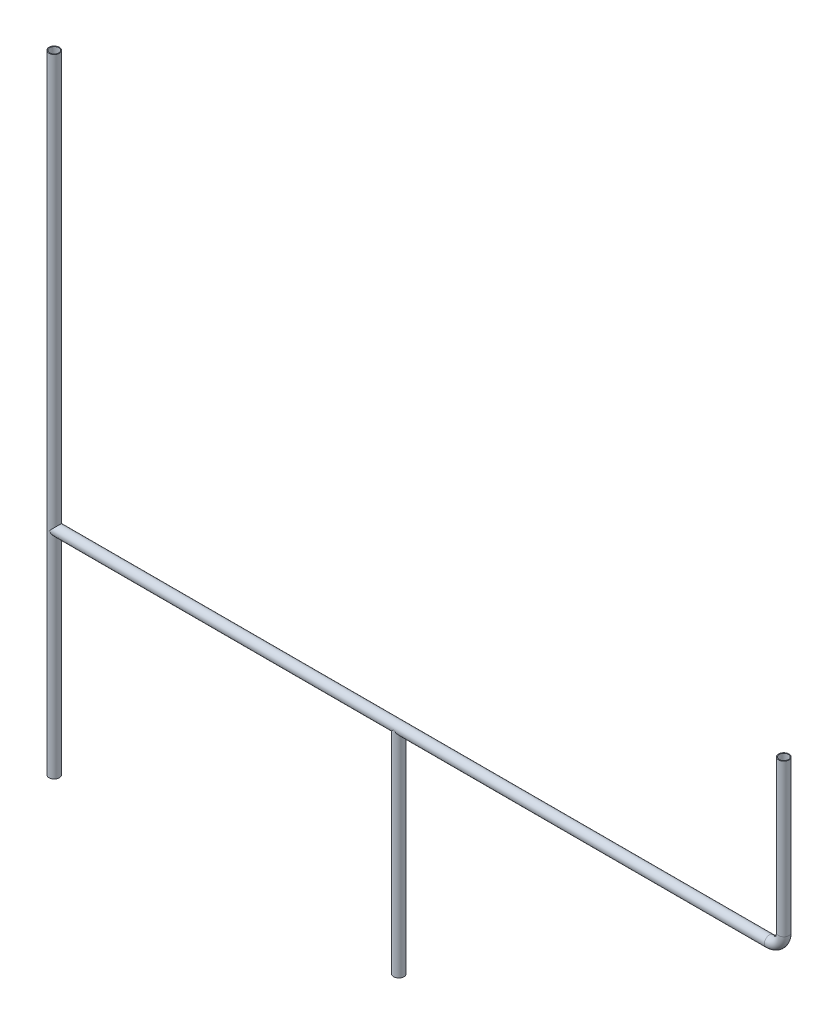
ISO-10303-21;
HEADER;
FILE_DESCRIPTION(('STEP AP214'),'2;1');
FILE_NAME('part.step','',(''),(''),'','','');
FILE_SCHEMA(('AUTOMOTIVE_DESIGN { 1 0 10303 214 1 1 1 1 }'));
ENDSEC;
DATA;
#1=APPLICATION_CONTEXT('core data for automotive mechanical design processes');
#2=APPLICATION_PROTOCOL_DEFINITION('international standard','automotive_design',2000,#1);
#3=PRODUCT_CONTEXT('',#1,'mechanical');
#4=PRODUCT('Part','Part','',(#3));
#5=PRODUCT_RELATED_PRODUCT_CATEGORY('part','',(#4));
#6=PRODUCT_DEFINITION_FORMATION('','',#4);
#7=PRODUCT_DEFINITION_CONTEXT('part definition',#1,'design');
#8=PRODUCT_DEFINITION('design','',#6,#7);
#9=PRODUCT_DEFINITION_SHAPE('','',#8);
#10=(LENGTH_UNIT() NAMED_UNIT(*) SI_UNIT(.MILLI.,.METRE.));
#11=(NAMED_UNIT(*) PLANE_ANGLE_UNIT() SI_UNIT($,.RADIAN.));
#12=(NAMED_UNIT(*) SI_UNIT($,.STERADIAN.) SOLID_ANGLE_UNIT());
#13=UNCERTAINTY_MEASURE_WITH_UNIT(LENGTH_MEASURE(1.E-05),#10,'distance_accuracy_value','');
#14=(GEOMETRIC_REPRESENTATION_CONTEXT(3) GLOBAL_UNCERTAINTY_ASSIGNED_CONTEXT((#13)) GLOBAL_UNIT_ASSIGNED_CONTEXT((#10,
#11,#12)) REPRESENTATION_CONTEXT('',''));
#15=CARTESIAN_POINT('',(0.,0.,0.));
#16=DIRECTION('',(0.,0.,1.));
#17=DIRECTION('',(1.,0.,0.));
#18=AXIS2_PLACEMENT_3D('',#15,#16,#17);
#19=CARTESIAN_POINT('',(1429.14210188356,0.,0.));
#20=DIRECTION('',(-1.,0.,0.));
#21=DIRECTION('',(0.,-1.,0.));
#22=AXIS2_PLACEMENT_3D('',#19,#20,#21);
#23=CYLINDRICAL_SURFACE('',#22,9.50000000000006);
#24=CARTESIAN_POINT('',(1429.14210188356,0.,0.));
#25=DIRECTION('',(-1.,0.,0.));
#26=DIRECTION('',(0.,0.,-1.));
#27=AXIS2_PLACEMENT_3D('',#24,#25,#26);
#28=CIRCLE('',#27,9.50000000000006);
#29=CARTESIAN_POINT('',(1429.14210188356,-9.50000000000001,0.));
#30=VERTEX_POINT('',#29);
#31=EDGE_CURVE('E315',#30,#30,#28,.T.);
#32=ORIENTED_EDGE('',*,*,#31,.F.);
#33=EDGE_LOOP('',(#32));
#34=FACE_BOUND('',#33,.T.);
#35=DIRECTION('',(-1.,0.,0.));
#36=VECTOR('',#35,1.);
#37=CARTESIAN_POINT('',(1429.14210188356,1.21045149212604E-13,-9.50000000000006));
#38=LINE('',#37,#36);
#39=CARTESIAN_POINT('',(-70.3126298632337,-1.10426440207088E-13,-9.50000000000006));
#40=VERTEX_POINT('',#39);
#41=CARTESIAN_POINT('',(-75.8578981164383,0.,-9.50000000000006));
#42=VERTEX_POINT('',#41);
#43=EDGE_CURVE('E297',#40,#42,#38,.T.);
#44=ORIENTED_EDGE('',*,*,#43,.F.);
#45=CARTESIAN_POINT('',(-70.3126298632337,-1.10426440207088E-13,-9.50000000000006));
#46=CARTESIAN_POINT('',(-70.3127597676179,-0.159030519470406,-9.50003867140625));
#47=CARTESIAN_POINT('',(-70.3057918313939,-0.317976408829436,-9.49600858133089));
#48=CARTESIAN_POINT('',(-70.2786849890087,-0.634007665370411,-9.48012715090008));
#49=CARTESIAN_POINT('',(-70.2585751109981,-0.791096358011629,-9.4682930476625));
#50=CARTESIAN_POINT('',(-70.2066219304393,-1.09993088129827,-9.43736801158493));
#51=CARTESIAN_POINT('',(-70.1749724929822,-1.25172200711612,-9.41839682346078));
#52=CARTESIAN_POINT('',(-70.1014226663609,-1.55182876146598,-9.37362550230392));
#53=CARTESIAN_POINT('',(-70.0595158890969,-1.70014216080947,-9.34782111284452));
#54=CARTESIAN_POINT('',(-69.9468657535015,-2.05673074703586,-9.27716646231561));
#55=CARTESIAN_POINT('',(-69.8715243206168,-2.26288046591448,-9.22892127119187));
#56=CARTESIAN_POINT('',(-69.7075827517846,-2.66654382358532,-9.12048679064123));
#57=CARTESIAN_POINT('',(-69.6189765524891,-2.86405345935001,-9.06029203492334));
#58=CARTESIAN_POINT('',(-69.4314815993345,-3.25238266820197,-8.92829357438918));
#59=CARTESIAN_POINT('',(-69.3325097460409,-3.44312868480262,-8.85639300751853));
#60=CARTESIAN_POINT('',(-69.1279452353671,-3.81662831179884,-8.70196478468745));
#61=CARTESIAN_POINT('',(-69.0223502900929,-3.99937912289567,-8.61943344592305));
#62=CARTESIAN_POINT('',(-68.7486311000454,-4.45425784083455,-8.3966684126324));
#63=CARTESIAN_POINT('',(-68.5776035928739,-4.72121031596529,-8.2493849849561));
#64=CARTESIAN_POINT('',(-68.2320792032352,-5.23831867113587,-7.93109035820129));
#65=CARTESIAN_POINT('',(-68.057580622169,-5.48846605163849,-7.76006728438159));
#66=CARTESIAN_POINT('',(-67.7105369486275,-5.97139673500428,-7.39485091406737));
#67=CARTESIAN_POINT('',(-67.537988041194,-6.20422221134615,-7.2007170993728));
#68=CARTESIAN_POINT('',(-67.1986290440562,-6.65239182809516,-6.78883169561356));
#69=CARTESIAN_POINT('',(-67.0318165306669,-6.86774340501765,-6.57109024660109));
#70=CARTESIAN_POINT('',(-66.7442604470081,-7.2331206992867,-6.16352634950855));
#71=CARTESIAN_POINT('',(-66.6215976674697,-7.38694101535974,-5.97844871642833));
#72=CARTESIAN_POINT('',(-66.3838531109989,-7.6821341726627,-5.59406064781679));
#73=CARTESIAN_POINT('',(-66.2687697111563,-7.82350968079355,-5.3947532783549));
#74=CARTESIAN_POINT('',(-66.0481471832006,-8.09241063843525,-4.98231183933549));
#75=CARTESIAN_POINT('',(-65.9425987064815,-8.21994967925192,-4.7691916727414));
#76=CARTESIAN_POINT('',(-65.7428630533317,-8.45980748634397,-4.32947311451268));
#77=CARTESIAN_POINT('',(-65.6486736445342,-8.57212924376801,-4.10287738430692));
#78=CARTESIAN_POINT('',(-65.4896727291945,-8.76083213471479,-3.67983615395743));
#79=CARTESIAN_POINT('',(-65.4226408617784,-8.84002735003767,-3.48547695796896));
#80=CARTESIAN_POINT('',(-65.2985305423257,-8.98619691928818,-3.08915065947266));
#81=CARTESIAN_POINT('',(-65.2414499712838,-9.05317387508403,-2.88718518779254));
#82=CARTESIAN_POINT('',(-65.1382551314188,-9.1739702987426,-2.47669543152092));
#83=CARTESIAN_POINT('',(-65.0921366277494,-9.22779484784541,-2.26817371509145));
#84=CARTESIAN_POINT('',(-65.0117285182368,-9.32147913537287,-1.84575806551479));
#85=CARTESIAN_POINT('',(-64.9774390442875,-9.36133871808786,-1.6318640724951));
#86=CARTESIAN_POINT('',(-64.9212664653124,-9.42656823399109,-1.19913460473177));
#87=CARTESIAN_POINT('',(-64.899446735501,-9.45186415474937,-0.980279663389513));
#88=CARTESIAN_POINT('',(-64.8689699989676,-9.48718193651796,-0.540421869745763));
#89=CARTESIAN_POINT('',(-64.8603130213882,-9.497203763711,-0.319419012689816));
#90=CARTESIAN_POINT('',(-64.8563614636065,-9.50177930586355,0.122842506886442));
#91=CARTESIAN_POINT('',(-64.8610654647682,-9.49633466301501,0.344101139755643));
#92=CARTESIAN_POINT('',(-64.8837247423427,-9.47008581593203,0.785010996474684));
#93=CARTESIAN_POINT('',(-64.9016793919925,-9.44928233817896,1.00466229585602));
#94=CARTESIAN_POINT('',(-64.9484706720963,-9.39498692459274,1.42305771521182));
#95=CARTESIAN_POINT('',(-64.9763180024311,-9.36264766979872,1.62206465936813));
#96=CARTESIAN_POINT('',(-65.0423749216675,-9.28579172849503,2.01602660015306));
#97=CARTESIAN_POINT('',(-65.0805879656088,-9.24127098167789,2.21098022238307));
#98=CARTESIAN_POINT('',(-65.1667114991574,-9.14068629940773,2.59564505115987));
#99=CARTESIAN_POINT('',(-65.2146203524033,-9.08462431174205,2.78535713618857));
#100=CARTESIAN_POINT('',(-65.3193878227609,-8.96165356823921,3.15870331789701));
#101=CARTESIAN_POINT('',(-65.3762476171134,-8.89474338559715,3.34233661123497));
#102=CARTESIAN_POINT('',(-65.5025702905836,-8.74554216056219,3.71602913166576));
#103=CARTESIAN_POINT('',(-65.572651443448,-8.66248324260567,3.90557288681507));
#104=CARTESIAN_POINT('',(-65.7211184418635,-8.48567001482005,4.2761653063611));
#105=CARTESIAN_POINT('',(-65.799504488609,-8.3919154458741,4.45721376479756));
#106=CARTESIAN_POINT('',(-66.0456681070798,-8.09580082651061,4.98715243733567));
#107=CARTESIAN_POINT('',(-66.2244535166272,-7.87858710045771,5.32284275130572));
#108=CARTESIAN_POINT('',(-66.5564703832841,-7.46841729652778,5.87888276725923));
#109=CARTESIAN_POINT('',(-66.7052263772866,-7.28256242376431,6.107337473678));
#110=CARTESIAN_POINT('',(-67.0114237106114,-6.89380036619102,6.542988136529));
#111=CARTESIAN_POINT('',(-67.1688655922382,-6.69089211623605,6.75018276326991));
#112=CARTESIAN_POINT('',(-67.4894960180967,-6.26889476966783,7.14384201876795));
#113=CARTESIAN_POINT('',(-67.6526981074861,-6.04976599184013,7.33025281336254));
#114=CARTESIAN_POINT('',(-67.9809343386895,-5.59652062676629,7.68187588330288));
#115=CARTESIAN_POINT('',(-68.1459679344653,-5.36240841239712,7.84709430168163));
#116=CARTESIAN_POINT('',(-68.4433095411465,-4.92412052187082,8.12757876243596));
#117=CARTESIAN_POINT('',(-68.5759938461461,-4.72247831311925,8.24641958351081));
#118=CARTESIAN_POINT('',(-68.8372149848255,-4.30880102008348,8.46991953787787));
#119=CARTESIAN_POINT('',(-68.9657509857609,-4.09676387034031,8.57457583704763));
#120=CARTESIAN_POINT('',(-69.2148804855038,-3.66214618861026,8.76899112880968));
#121=CARTESIAN_POINT('',(-69.3354916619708,-3.43959116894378,8.85878400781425));
#122=CARTESIAN_POINT('',(-69.5643634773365,-2.98289635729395,9.0228169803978));
#123=CARTESIAN_POINT('',(-69.6726332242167,-2.74876529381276,9.09706857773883));
#124=CARTESIAN_POINT('',(-69.8899589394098,-2.22135384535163,9.2414198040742));
#125=CARTESIAN_POINT('',(-69.9951329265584,-1.92537938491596,9.30795167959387));
#126=CARTESIAN_POINT('',(-70.122921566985,-1.470062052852,9.38682965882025));
#127=CARTESIAN_POINT('',(-70.1604854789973,-1.31665591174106,9.40961550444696));
#128=CARTESIAN_POINT('',(-70.224049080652,-1.00659420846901,9.44781032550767));
#129=CARTESIAN_POINT('',(-70.2500563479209,-0.849940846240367,9.46322413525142));
#130=CARTESIAN_POINT('',(-70.2837705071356,-0.577745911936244,9.4831103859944));
#131=CARTESIAN_POINT('',(-70.2945400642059,-0.462710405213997,9.48942409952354));
#132=CARTESIAN_POINT('',(-70.3089955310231,-0.231794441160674,9.49787858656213));
#133=CARTESIAN_POINT('',(-70.312666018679,-0.115912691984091,9.50001027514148));
#134=CARTESIAN_POINT('',(-70.3126298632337,-1.09415342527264E-13,9.50000000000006));
#135=B_SPLINE_CURVE_WITH_KNOTS('',3,(#45,#46,#47,#48,#49,#50,#51,#52,#53,#54,#55,#56,#57,#58,
#59,#60,#61,#62,#63,#64,#65,#66,#67,#68,#69,#70,#71,#72,#73,#74,#75,#76,#77,#78,#79,#80,#81,#82,
#83,#84,#85,#86,#87,#88,#89,#90,#91,#92,#93,#94,#95,#96,#97,#98,#99,#100,#101,#102,#103,#104,
#105,#106,#107,#108,#109,#110,#111,#112,#113,#114,#115,#116,#117,#118,#119,#120,#121,#122,#123,
#124,#125,#126,#127,#128,#129,#130,#131,#132,#133,#134),.UNSPECIFIED.,.F.,.F.,(4,2,2,2,2,2,2,2,
2,2,2,2,2,2,2,2,2,2,2,2,2,2,2,2,2,2,2,2,2,2,2,2,2,2,2,2,2,2,2,2,2,2,2,2,4),(0.,
0.476752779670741,0.952456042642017,1.42051030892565,1.88885681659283,2.56190776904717,
3.23526731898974,3.91451190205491,4.59399243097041,5.64132729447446,6.68918794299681,
7.73440768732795,8.77918024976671,9.58882785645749,10.3983015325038,11.2069727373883,
12.0154847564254,12.6758045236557,13.3359835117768,13.9959070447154,14.6558379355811,
15.3190936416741,15.9823508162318,16.6455375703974,17.3086929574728,17.9186112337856,
18.5287330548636,19.1387519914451,19.7488512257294,20.4036663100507,21.0584972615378,
22.3681362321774,23.3568168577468,24.3455592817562,25.3368059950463,26.3277647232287,
27.1343649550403,27.9411261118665,28.7460218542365,29.5503196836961,30.5098623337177,
30.9880792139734,31.465982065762,31.8128350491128,32.1604406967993),.UNSPECIFIED.);
#136=CARTESIAN_POINT('',(-70.3126298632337,-1.10426440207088E-13,9.50000000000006));
#137=VERTEX_POINT('',#136);
#138=EDGE_CURVE('E164',#40,#137,#135,.T.);
#139=ORIENTED_EDGE('',*,*,#138,.T.);
#140=DIRECTION('',(-1.,0.,0.));
#141=VECTOR('',#140,1.);
#142=CARTESIAN_POINT('',(1429.14210188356,1.21045149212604E-13,9.50000000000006));
#143=LINE('',#142,#141);
#144=CARTESIAN_POINT('',(-75.8578981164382,-1.11022302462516E-13,9.50000000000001));
#145=VERTEX_POINT('',#144);
#146=EDGE_CURVE('E171',#145,#137,#143,.F.);
#147=ORIENTED_EDGE('',*,*,#146,.F.);
#148=CARTESIAN_POINT('',(-75.8578981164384,-1.54706385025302E-13,0.));
#149=DIRECTION('',(-0.707106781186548,0.707106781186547,0.));
#150=DIRECTION('',(-0.707106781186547,-0.707106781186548,0.));
#151=AXIS2_PLACEMENT_3D('',#148,#149,#150);
#152=ELLIPSE('',#151,13.4350288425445,9.50000000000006);
#153=EDGE_CURVE('E287',#42,#145,#152,.F.);
#154=ORIENTED_EDGE('',*,*,#153,.F.);
#155=EDGE_LOOP('',(#44,#139,#147,#154));
#156=FACE_BOUND('',#155,.T.);
#157=DIRECTION('',(-1.,0.,0.));
#158=VECTOR('',#157,1.);
#159=CARTESIAN_POINT('',(1429.14210188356,1.20274161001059E-13,9.50000000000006));
#160=LINE('',#159,#158);
#161=CARTESIAN_POINT('',(643.596833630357,0.,9.50000000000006));
#162=VERTEX_POINT('',#161);
#163=CARTESIAN_POINT('',(649.142101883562,0.,9.49999999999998));
#164=VERTEX_POINT('',#163);
#165=EDGE_CURVE('E12',#162,#164,#160,.F.);
#166=ORIENTED_EDGE('',*,*,#165,.F.);
#167=CARTESIAN_POINT('',(643.596833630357,0.,9.50000000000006));
#168=CARTESIAN_POINT('',(643.596963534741,-0.159030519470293,9.50003867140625));
#169=CARTESIAN_POINT('',(643.589995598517,-0.317976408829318,9.49600858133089));
#170=CARTESIAN_POINT('',(643.562888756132,-0.634007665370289,9.48012715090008));
#171=CARTESIAN_POINT('',(643.542778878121,-0.791096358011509,9.46829304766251));
#172=CARTESIAN_POINT('',(643.490825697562,-1.09993088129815,9.43736801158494));
#173=CARTESIAN_POINT('',(643.459176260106,-1.251722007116,9.41839682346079));
#174=CARTESIAN_POINT('',(643.385626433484,-1.55182876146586,9.37362550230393));
#175=CARTESIAN_POINT('',(643.34371965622,-1.70014216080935,9.34782111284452));
#176=CARTESIAN_POINT('',(643.231069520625,-2.05673074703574,9.27716646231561));
#177=CARTESIAN_POINT('',(643.15572808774,-2.26288046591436,9.22892127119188));
#178=CARTESIAN_POINT('',(642.991786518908,-2.66654382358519,9.12048679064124));
#179=CARTESIAN_POINT('',(642.903180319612,-2.86405345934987,9.06029203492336));
#180=CARTESIAN_POINT('',(642.715685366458,-3.25238266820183,8.9282935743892));
#181=CARTESIAN_POINT('',(642.616713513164,-3.44312868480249,8.85639300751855));
#182=CARTESIAN_POINT('',(642.41214900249,-3.81662831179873,8.70196478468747));
#183=CARTESIAN_POINT('',(642.306554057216,-3.99937912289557,8.61943344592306));
#184=CARTESIAN_POINT('',(642.032834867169,-4.45425784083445,8.39666841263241));
#185=CARTESIAN_POINT('',(641.861807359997,-4.72121031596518,8.24938498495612));
#186=CARTESIAN_POINT('',(641.516282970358,-5.23831867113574,7.93109035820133));
#187=CARTESIAN_POINT('',(641.341784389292,-5.48846605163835,7.76006728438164));
#188=CARTESIAN_POINT('',(640.994740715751,-5.97139673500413,7.39485091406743));
#189=CARTESIAN_POINT('',(640.822191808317,-6.20422221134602,7.20071709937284));
#190=CARTESIAN_POINT('',(640.482832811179,-6.65239182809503,6.78883169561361));
#191=CARTESIAN_POINT('',(640.31602029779,-6.86774340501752,6.57109024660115));
#192=CARTESIAN_POINT('',(640.028464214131,-7.23312069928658,6.16352634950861));
#193=CARTESIAN_POINT('',(639.905801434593,-7.38694101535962,5.97844871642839));
#194=CARTESIAN_POINT('',(639.668056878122,-7.68213417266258,5.59406064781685));
#195=CARTESIAN_POINT('',(639.55297347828,-7.82350968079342,5.39475327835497));
#196=CARTESIAN_POINT('',(639.332350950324,-8.09241063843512,4.98231183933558));
#197=CARTESIAN_POINT('',(639.226802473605,-8.21994967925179,4.76919167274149));
#198=CARTESIAN_POINT('',(639.027066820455,-8.45980748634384,4.32947311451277));
#199=CARTESIAN_POINT('',(638.932877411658,-8.57212924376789,4.10287738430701));
#200=CARTESIAN_POINT('',(638.773876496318,-8.76083213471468,3.67983615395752));
#201=CARTESIAN_POINT('',(638.706844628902,-8.84002735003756,3.48547695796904));
#202=CARTESIAN_POINT('',(638.582734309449,-8.98619691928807,3.08915065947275));
#203=CARTESIAN_POINT('',(638.525653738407,-9.05317387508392,2.88718518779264));
#204=CARTESIAN_POINT('',(638.422458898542,-9.1739702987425,2.47669543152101));
#205=CARTESIAN_POINT('',(638.376340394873,-9.22779484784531,2.26817371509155));
#206=CARTESIAN_POINT('',(638.29593228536,-9.32147913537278,1.84575806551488));
#207=CARTESIAN_POINT('',(638.261642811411,-9.36133871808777,1.63186407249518));
#208=CARTESIAN_POINT('',(638.205470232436,-9.42656823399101,1.19913460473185));
#209=CARTESIAN_POINT('',(638.183650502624,-9.45186415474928,0.980279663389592));
#210=CARTESIAN_POINT('',(638.153173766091,-9.48718193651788,0.540421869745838));
#211=CARTESIAN_POINT('',(638.144516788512,-9.49720376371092,0.319419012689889));
#212=CARTESIAN_POINT('',(638.14056523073,-9.50177930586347,-0.122842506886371));
#213=CARTESIAN_POINT('',(638.145269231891,-9.49633466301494,-0.344101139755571));
#214=CARTESIAN_POINT('',(638.167928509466,-9.47008581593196,-0.785010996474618));
#215=CARTESIAN_POINT('',(638.185883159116,-9.44928233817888,-1.00466229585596));
#216=CARTESIAN_POINT('',(638.23267443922,-9.39498692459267,-1.42305771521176));
#217=CARTESIAN_POINT('',(638.260521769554,-9.36264766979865,-1.62206465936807));
#218=CARTESIAN_POINT('',(638.326578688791,-9.28579172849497,-2.016026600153));
#219=CARTESIAN_POINT('',(638.364791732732,-9.24127098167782,-2.21098022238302));
#220=CARTESIAN_POINT('',(638.450915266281,-9.14068629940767,-2.59564505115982));
#221=CARTESIAN_POINT('',(638.498824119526,-9.08462431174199,-2.78535713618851));
#222=CARTESIAN_POINT('',(638.603591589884,-8.96165356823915,-3.15870331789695));
#223=CARTESIAN_POINT('',(638.660451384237,-8.89474338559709,-3.34233661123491));
#224=CARTESIAN_POINT('',(638.786774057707,-8.74554216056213,-3.71602913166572));
#225=CARTESIAN_POINT('',(638.856855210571,-8.66248324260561,-3.90557288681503));
#226=CARTESIAN_POINT('',(639.005322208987,-8.48567001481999,-4.27616530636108));
#227=CARTESIAN_POINT('',(639.083708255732,-8.39191544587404,-4.45721376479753));
#228=CARTESIAN_POINT('',(639.329871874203,-8.09580082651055,-4.98715243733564));
#229=CARTESIAN_POINT('',(639.50865728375,-7.87858710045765,-5.32284275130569));
#230=CARTESIAN_POINT('',(639.840674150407,-7.46841729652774,-5.87888276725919));
#231=CARTESIAN_POINT('',(639.98943014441,-7.28256242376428,-6.10733747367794));
#232=CARTESIAN_POINT('',(640.295627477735,-6.89380036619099,-6.54298813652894));
#233=CARTESIAN_POINT('',(640.453069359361,-6.69089211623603,-6.75018276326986));
#234=CARTESIAN_POINT('',(640.77369978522,-6.2688947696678,-7.1438420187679));
#235=CARTESIAN_POINT('',(640.936901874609,-6.0497659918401,-7.3302528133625));
#236=CARTESIAN_POINT('',(641.265138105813,-5.59652062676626,-7.68187588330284));
#237=CARTESIAN_POINT('',(641.430171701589,-5.36240841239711,-7.84709430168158));
#238=CARTESIAN_POINT('',(641.72751330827,-4.9241205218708,-8.12757876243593));
#239=CARTESIAN_POINT('',(641.860197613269,-4.7224783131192,-8.24641958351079));
#240=CARTESIAN_POINT('',(642.121418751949,-4.30880102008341,-8.46991953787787));
#241=CARTESIAN_POINT('',(642.249954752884,-4.09676387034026,-8.57457583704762));
#242=CARTESIAN_POINT('',(642.499084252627,-3.6621461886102,-8.76899112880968));
#243=CARTESIAN_POINT('',(642.619695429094,-3.43959116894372,-8.85878400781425));
#244=CARTESIAN_POINT('',(642.84856724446,-2.98289635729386,-9.02281698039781));
#245=CARTESIAN_POINT('',(642.95683699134,-2.74876529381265,-9.09706857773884));
#246=CARTESIAN_POINT('',(643.174162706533,-2.22135384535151,-9.24141980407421));
#247=CARTESIAN_POINT('',(643.279336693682,-1.92537938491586,-9.30795167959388));
#248=CARTESIAN_POINT('',(643.407125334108,-1.4700620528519,-9.38682965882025));
#249=CARTESIAN_POINT('',(643.444689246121,-1.31665591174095,-9.40961550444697));
#250=CARTESIAN_POINT('',(643.508252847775,-1.0065942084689,-9.44781032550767));
#251=CARTESIAN_POINT('',(643.534260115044,-0.849940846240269,-9.46322413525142));
#252=CARTESIAN_POINT('',(643.567974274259,-0.577745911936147,-9.4831103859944));
#253=CARTESIAN_POINT('',(643.578743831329,-0.462710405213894,-9.48942409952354));
#254=CARTESIAN_POINT('',(643.593199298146,-0.231794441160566,-9.49787858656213));
#255=CARTESIAN_POINT('',(643.596869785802,-0.115912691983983,-9.50001027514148));
#256=CARTESIAN_POINT('',(643.596833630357,0.,-9.50000000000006));
#257=B_SPLINE_CURVE_WITH_KNOTS('',3,(#167,#168,#169,#170,#171,#172,#173,#174,#175,#176,#177,
#178,#179,#180,#181,#182,#183,#184,#185,#186,#187,#188,#189,#190,#191,#192,#193,#194,#195,#196,
#197,#198,#199,#200,#201,#202,#203,#204,#205,#206,#207,#208,#209,#210,#211,#212,#213,#214,#215,
#216,#217,#218,#219,#220,#221,#222,#223,#224,#225,#226,#227,#228,#229,#230,#231,#232,#233,#234,
#235,#236,#237,#238,#239,#240,#241,#242,#243,#244,#245,#246,#247,#248,#249,#250,#251,#252,#253,
#254,#255,#256),.UNSPECIFIED.,.F.,.F.,(4,2,2,2,2,2,2,2,2,2,2,2,2,2,2,2,2,2,2,2,2,2,2,2,2,2,2,2,
2,2,2,2,2,2,2,2,2,2,2,2,2,2,2,2,4),(0.,0.476752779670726,0.95245604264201,1.42051030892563,
1.88885681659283,2.56190776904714,3.23526731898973,3.91451190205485,4.59399243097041,
5.64132729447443,6.68918794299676,7.7344076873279,8.77918024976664,9.58882785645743,
10.3983015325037,11.2069727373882,12.0154847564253,12.6758045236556,13.3359835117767,
13.9959070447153,14.655837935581,15.319093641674,15.9823508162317,16.6455375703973,
17.3086929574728,17.9186112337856,18.5287330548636,19.1387519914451,19.7488512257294,
20.4036663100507,21.0584972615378,22.3681362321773,23.3568168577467,24.3455592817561,
25.3368059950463,26.3277647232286,27.1343649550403,27.9411261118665,28.7460218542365,
29.5503196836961,30.5098623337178,30.9880792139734,31.465982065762,31.8128350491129,
32.1604406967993),.UNSPECIFIED.);
#258=CARTESIAN_POINT('',(643.596833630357,0.,-9.50000000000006));
#259=VERTEX_POINT('',#258);
#260=EDGE_CURVE('E36',#162,#259,#257,.T.);
#261=ORIENTED_EDGE('',*,*,#260,.T.);
#262=DIRECTION('',(-1.,0.,0.));
#263=VECTOR('',#262,1.);
#264=CARTESIAN_POINT('',(1429.14210188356,1.20274161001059E-13,-9.50000000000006));
#265=LINE('',#264,#263);
#266=CARTESIAN_POINT('',(649.142101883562,0.,-9.50000000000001));
#267=VERTEX_POINT('',#266);
#268=EDGE_CURVE('E55',#267,#259,#265,.T.);
#269=ORIENTED_EDGE('',*,*,#268,.F.);
#270=CARTESIAN_POINT('',(654.687370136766,0.,-9.50000000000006));
#271=VERTEX_POINT('',#270);
#272=EDGE_CURVE('E46',#271,#267,#265,.T.);
#273=ORIENTED_EDGE('',*,*,#272,.F.);
#274=CARTESIAN_POINT('',(654.687370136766,0.,-9.50000000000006));
#275=CARTESIAN_POINT('',(654.687240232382,-0.159030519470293,-9.50003867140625));
#276=CARTESIAN_POINT('',(654.694208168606,-0.317976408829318,-9.49600858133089));
#277=CARTESIAN_POINT('',(654.721315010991,-0.63400766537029,-9.48012715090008));
#278=CARTESIAN_POINT('',(654.741424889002,-0.791096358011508,-9.46829304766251));
#279=CARTESIAN_POINT('',(654.793378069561,-1.09993088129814,-9.43736801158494));
#280=CARTESIAN_POINT('',(654.825027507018,-1.251722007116,-9.41839682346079));
#281=CARTESIAN_POINT('',(654.898577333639,-1.55182876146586,-9.37362550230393));
#282=CARTESIAN_POINT('',(654.940484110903,-1.70014216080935,-9.34782111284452));
#283=CARTESIAN_POINT('',(655.053134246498,-2.05673074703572,-9.27716646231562));
#284=CARTESIAN_POINT('',(655.128475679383,-2.26288046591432,-9.22892127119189));
#285=CARTESIAN_POINT('',(655.292417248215,-2.66654382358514,-9.12048679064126));
#286=CARTESIAN_POINT('',(655.381023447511,-2.86405345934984,-9.06029203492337));
#287=CARTESIAN_POINT('',(655.568518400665,-3.25238266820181,-8.9282935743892));
#288=CARTESIAN_POINT('',(655.667490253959,-3.44312868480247,-8.85639300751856));
#289=CARTESIAN_POINT('',(655.872054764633,-3.81662831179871,-8.70196478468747));
#290=CARTESIAN_POINT('',(655.977649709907,-3.99937912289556,-8.61943344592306));
#291=CARTESIAN_POINT('',(656.251368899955,-4.45425784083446,-8.39666841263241));
#292=CARTESIAN_POINT('',(656.422396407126,-4.7212103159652,-8.24938498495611));
#293=CARTESIAN_POINT('',(656.767920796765,-5.23831867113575,-7.93109035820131));
#294=CARTESIAN_POINT('',(656.942419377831,-5.48846605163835,-7.76006728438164));
#295=CARTESIAN_POINT('',(657.289463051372,-5.97139673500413,-7.39485091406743));
#296=CARTESIAN_POINT('',(657.462011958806,-6.20422221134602,-7.20071709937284));
#297=CARTESIAN_POINT('',(657.801370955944,-6.65239182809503,-6.78883169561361));
#298=CARTESIAN_POINT('',(657.968183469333,-6.86774340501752,-6.57109024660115));
#299=CARTESIAN_POINT('',(658.255739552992,-7.23312069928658,-6.1635263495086));
#300=CARTESIAN_POINT('',(658.37840233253,-7.38694101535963,-5.97844871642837));
#301=CARTESIAN_POINT('',(658.616146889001,-7.68213417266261,-5.59406064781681));
#302=CARTESIAN_POINT('',(658.731230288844,-7.82350968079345,-5.39475327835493));
#303=CARTESIAN_POINT('',(658.951852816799,-8.09241063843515,-4.98231183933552));
#304=CARTESIAN_POINT('',(659.057401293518,-8.21994967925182,-4.76919167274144));
#305=CARTESIAN_POINT('',(659.257136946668,-8.45980748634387,-4.32947311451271));
#306=CARTESIAN_POINT('',(659.351326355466,-8.57212924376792,-4.10287738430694));
#307=CARTESIAN_POINT('',(659.510327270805,-8.7608321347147,-3.67983615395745));
#308=CARTESIAN_POINT('',(659.577359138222,-8.84002735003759,-3.48547695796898));
#309=CARTESIAN_POINT('',(659.701469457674,-8.98619691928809,-3.08915065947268));
#310=CARTESIAN_POINT('',(659.758550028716,-9.05317387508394,-2.88718518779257));
#311=CARTESIAN_POINT('',(659.861744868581,-9.17397029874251,-2.47669543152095));
#312=CARTESIAN_POINT('',(659.907863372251,-9.22779484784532,-2.26817371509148));
#313=CARTESIAN_POINT('',(659.988271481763,-9.32147913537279,-1.84575806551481));
#314=CARTESIAN_POINT('',(660.022560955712,-9.36133871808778,-1.63186407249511));
#315=CARTESIAN_POINT('',(660.078733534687,-9.42656823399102,-1.19913460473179));
#316=CARTESIAN_POINT('',(660.100553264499,-9.45186415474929,-0.980279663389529));
#317=CARTESIAN_POINT('',(660.131030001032,-9.48718193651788,-0.540421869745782));
#318=CARTESIAN_POINT('',(660.139686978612,-9.49720376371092,-0.319419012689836));
#319=CARTESIAN_POINT('',(660.143638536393,-9.50177930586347,0.122842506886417));
#320=CARTESIAN_POINT('',(660.138934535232,-9.49633466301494,0.344101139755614));
#321=CARTESIAN_POINT('',(660.116275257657,-9.47008581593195,0.785010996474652));
#322=CARTESIAN_POINT('',(660.098320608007,-9.44928233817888,1.00466229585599));
#323=CARTESIAN_POINT('',(660.051529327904,-9.39498692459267,1.42305771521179));
#324=CARTESIAN_POINT('',(660.023681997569,-9.36264766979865,1.62206465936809));
#325=CARTESIAN_POINT('',(659.957625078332,-9.28579172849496,2.01602660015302));
#326=CARTESIAN_POINT('',(659.919412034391,-9.24127098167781,2.21098022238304));
#327=CARTESIAN_POINT('',(659.833288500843,-9.14068629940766,2.59564505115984));
#328=CARTESIAN_POINT('',(659.785379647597,-9.08462431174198,2.78535713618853));
#329=CARTESIAN_POINT('',(659.680612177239,-8.96165356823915,3.15870331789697));
#330=CARTESIAN_POINT('',(659.623752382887,-8.89474338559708,3.34233661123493));
#331=CARTESIAN_POINT('',(659.497429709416,-8.74554216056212,3.71602913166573));
#332=CARTESIAN_POINT('',(659.427348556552,-8.6624832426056,3.90557288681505));
#333=CARTESIAN_POINT('',(659.278881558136,-8.48567001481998,4.27616530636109));
#334=CARTESIAN_POINT('',(659.200495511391,-8.39191544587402,4.45721376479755));
#335=CARTESIAN_POINT('',(658.95433189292,-8.09580082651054,4.98715243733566));
#336=CARTESIAN_POINT('',(658.775546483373,-7.87858710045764,5.32284275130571));
#337=CARTESIAN_POINT('',(658.443529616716,-7.46841729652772,5.87888276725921));
#338=CARTESIAN_POINT('',(658.294773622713,-7.28256242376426,6.10733747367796));
#339=CARTESIAN_POINT('',(657.988576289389,-6.89380036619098,6.54298813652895));
#340=CARTESIAN_POINT('',(657.831134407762,-6.69089211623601,6.75018276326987));
#341=CARTESIAN_POINT('',(657.510503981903,-6.26889476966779,7.14384201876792));
#342=CARTESIAN_POINT('',(657.347301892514,-6.04976599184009,7.33025281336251));
#343=CARTESIAN_POINT('',(657.01906566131,-5.59652062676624,7.68187588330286));
#344=CARTESIAN_POINT('',(656.854032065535,-5.36240841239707,7.84709430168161));
#345=CARTESIAN_POINT('',(656.556690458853,-4.92412052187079,8.12757876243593));
#346=CARTESIAN_POINT('',(656.424006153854,-4.72247831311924,8.24641958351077));
#347=CARTESIAN_POINT('',(656.162785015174,-4.30880102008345,8.46991953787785));
#348=CARTESIAN_POINT('',(656.034249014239,-4.09676387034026,8.57457583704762));
#349=CARTESIAN_POINT('',(655.785119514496,-3.66214618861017,8.76899112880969));
#350=CARTESIAN_POINT('',(655.664508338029,-3.4395911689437,8.85878400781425));
#351=CARTESIAN_POINT('',(655.435636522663,-2.98289635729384,9.02281698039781));
#352=CARTESIAN_POINT('',(655.327366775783,-2.74876529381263,9.09706857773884));
#353=CARTESIAN_POINT('',(655.11004106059,-2.22135384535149,9.24141980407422));
#354=CARTESIAN_POINT('',(655.004867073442,-1.92537938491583,9.30795167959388));
#355=CARTESIAN_POINT('',(654.877078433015,-1.47006205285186,9.38682965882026));
#356=CARTESIAN_POINT('',(654.839514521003,-1.3166559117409,9.40961550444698));
#357=CARTESIAN_POINT('',(654.775950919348,-1.00659420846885,9.44781032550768));
#358=CARTESIAN_POINT('',(654.749943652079,-0.849940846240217,9.46322413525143));
#359=CARTESIAN_POINT('',(654.716229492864,-0.577745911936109,9.4831103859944));
#360=CARTESIAN_POINT('',(654.705459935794,-0.462710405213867,9.48942409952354));
#361=CARTESIAN_POINT('',(654.691004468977,-0.231794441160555,9.49787858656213));
#362=CARTESIAN_POINT('',(654.687333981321,-0.115912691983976,9.50001027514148));
#363=CARTESIAN_POINT('',(654.687370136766,0.,9.50000000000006));
#364=B_SPLINE_CURVE_WITH_KNOTS('',3,(#274,#275,#276,#277,#278,#279,#280,#281,#282,#283,#284,
#285,#286,#287,#288,#289,#290,#291,#292,#293,#294,#295,#296,#297,#298,#299,#300,#301,#302,#303,
#304,#305,#306,#307,#308,#309,#310,#311,#312,#313,#314,#315,#316,#317,#318,#319,#320,#321,#322,
#323,#324,#325,#326,#327,#328,#329,#330,#331,#332,#333,#334,#335,#336,#337,#338,#339,#340,#341,
#342,#343,#344,#345,#346,#347,#348,#349,#350,#351,#352,#353,#354,#355,#356,#357,#358,#359,#360,
#361,#362,#363),.UNSPECIFIED.,.F.,.F.,(4,2,2,2,2,2,2,2,2,2,2,2,2,2,2,2,2,2,2,2,2,2,2,2,2,2,2,2,
2,2,2,2,2,2,2,2,2,2,2,2,2,2,2,2,4),(0.,0.476752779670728,0.952456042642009,1.42051030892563,
1.88885681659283,2.5619077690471,3.23526731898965,3.91451190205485,4.59399243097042,
5.64132729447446,6.68918794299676,7.73440768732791,8.77918024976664,9.58882785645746,
10.3983015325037,11.2069727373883,12.0154847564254,12.6758045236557,13.3359835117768,
13.9959070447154,14.6558379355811,15.3190936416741,15.9823508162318,16.6455375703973,
17.3086929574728,17.9186112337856,18.5287330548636,19.1387519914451,19.7488512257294,
20.4036663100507,21.0584972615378,22.3681362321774,23.3568168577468,24.3455592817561,
25.3368059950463,26.3277647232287,27.1343649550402,27.9411261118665,28.7460218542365,
29.5503196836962,30.5098623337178,30.9880792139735,31.4659820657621,31.8128350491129,
32.1604406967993),.UNSPECIFIED.);
#365=CARTESIAN_POINT('',(654.687370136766,0.,9.50000000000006));
#366=VERTEX_POINT('',#365);
#367=EDGE_CURVE('E184',#271,#366,#364,.T.);
#368=ORIENTED_EDGE('',*,*,#367,.T.);
#369=EDGE_CURVE('E48',#164,#366,#160,.F.);
#370=ORIENTED_EDGE('',*,*,#369,.F.);
#371=EDGE_LOOP('',(#166,#261,#269,#273,#368,#370));
#372=FACE_BOUND('',#371,.T.);
#373=ADVANCED_FACE('F32',(#34,#156,#372),#23,.F.);
#374=CARTESIAN_POINT('',(-75.8578981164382,-1.61718541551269E-13,0.));
#375=DIRECTION('',(-0.707106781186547,-0.707106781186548,0.));
#376=DIRECTION('',(-0.707106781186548,0.707106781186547,0.));
#377=AXIS2_PLACEMENT_3D('',#374,#375,#376);
#378=ELLIPSE('',#377,13.4350288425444,9.50000000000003);
#379=EDGE_CURVE('E290',#42,#145,#378,.T.);
#380=ORIENTED_EDGE('',*,*,#379,.F.);
#381=EDGE_CURVE('E280',#145,#42,#152,.F.);
#382=ORIENTED_EDGE('',*,*,#381,.F.);
#383=EDGE_LOOP('',(#380,#382));
#384=FACE_BOUND('',#383,.T.);
#385=ADVANCED_FACE('F177',(#384),#23,.F.);
#386=CARTESIAN_POINT('',(-75.8578981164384,-1.54706385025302E-13,0.));
#387=DIRECTION('',(0.,1.,0.));
#388=DIRECTION('',(0.,0.,1.));
#389=AXIS2_PLACEMENT_3D('',#386,#387,#388);
#390=CYLINDRICAL_SURFACE('',#389,10.9999999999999);
#391=CARTESIAN_POINT('',(-75.8578981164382,-1.61718541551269E-13,0.));
#392=DIRECTION('',(-0.707106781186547,-0.707106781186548,0.));
#393=DIRECTION('',(-0.707106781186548,0.707106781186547,0.));
#394=AXIS2_PLACEMENT_3D('',#391,#392,#393);
#395=ELLIPSE('',#394,15.556349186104,11.);
#396=CARTESIAN_POINT('',(-75.8578981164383,-1.11022302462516E-13,-10.9999999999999));
#397=VERTEX_POINT('',#396);
#398=CARTESIAN_POINT('',(-75.8578981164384,0.,10.9999999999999));
#399=VERTEX_POINT('',#398);
#400=EDGE_CURVE('E136',#397,#399,#395,.T.);
#401=ORIENTED_EDGE('',*,*,#400,.T.);
#402=CARTESIAN_POINT('',(-75.8578981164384,-1.54706385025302E-13,0.));
#403=DIRECTION('',(-0.707106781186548,0.707106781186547,0.));
#404=DIRECTION('',(-0.707106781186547,-0.707106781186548,0.));
#405=AXIS2_PLACEMENT_3D('',#402,#403,#404);
#406=ELLIPSE('',#405,15.5563491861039,10.9999999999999);
#407=EDGE_CURVE('E294',#397,#399,#406,.F.);
#408=ORIENTED_EDGE('',*,*,#407,.F.);
#409=EDGE_LOOP('',(#401,#408));
#410=FACE_BOUND('',#409,.T.);
#411=CARTESIAN_POINT('',(-75.8578981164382,-450.,0.));
#412=DIRECTION('',(0.,-1.,0.));
#413=DIRECTION('',(1.,0.,0.));
#414=AXIS2_PLACEMENT_3D('',#411,#412,#413);
#415=CIRCLE('',#414,11.);
#416=CARTESIAN_POINT('',(-64.8578981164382,-450.,0.));
#417=VERTEX_POINT('',#416);
#418=EDGE_CURVE('E122',#417,#417,#415,.T.);
#419=ORIENTED_EDGE('',*,*,#418,.F.);
#420=EDGE_LOOP('',(#419));
#421=FACE_BOUND('',#420,.T.);
#422=CARTESIAN_POINT('',(-75.8578981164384,870.,0.));
#423=DIRECTION('',(0.,1.,0.));
#424=DIRECTION('',(0.,0.,1.));
#425=AXIS2_PLACEMENT_3D('',#422,#423,#424);
#426=CIRCLE('',#425,10.9999999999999);
#427=CARTESIAN_POINT('',(-75.8578981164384,870.,10.9999999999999));
#428=VERTEX_POINT('',#427);
#429=EDGE_CURVE('E286',#428,#428,#426,.T.);
#430=ORIENTED_EDGE('',*,*,#429,.F.);
#431=EDGE_LOOP('',(#430));
#432=FACE_BOUND('',#431,.T.);
#433=ADVANCED_FACE('F271',(#410,#421,#432),#390,.T.);
#434=CARTESIAN_POINT('',(-75.8578981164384,-1.54706385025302E-13,0.));
#435=DIRECTION('',(0.,1.,0.));
#436=DIRECTION('',(0.,0.,1.));
#437=AXIS2_PLACEMENT_3D('',#434,#435,#436);
#438=CYLINDRICAL_SURFACE('',#437,9.50000000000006);
#439=ORIENTED_EDGE('',*,*,#381,.T.);
#440=ORIENTED_EDGE('',*,*,#153,.T.);
#441=EDGE_LOOP('',(#439,#440));
#442=FACE_BOUND('',#441,.T.);
#443=CARTESIAN_POINT('',(-75.8578981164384,870.,0.));
#444=DIRECTION('',(0.,1.,0.));
#445=DIRECTION('',(0.,0.,1.));
#446=AXIS2_PLACEMENT_3D('',#443,#444,#445);
#447=CIRCLE('',#446,9.50000000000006);
#448=CARTESIAN_POINT('',(-75.8578981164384,870.,9.50000000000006));
#449=VERTEX_POINT('',#448);
#450=EDGE_CURVE('E284',#449,#449,#447,.T.);
#451=ORIENTED_EDGE('',*,*,#450,.T.);
#452=EDGE_LOOP('',(#451));
#453=FACE_BOUND('',#452,.T.);
#454=ADVANCED_FACE('F34',(#442,#453),#438,.F.);
#455=CARTESIAN_POINT('',(1429.14210188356,0.,0.));
#456=DIRECTION('',(-1.,0.,0.));
#457=DIRECTION('',(0.,-1.,0.));
#458=AXIS2_PLACEMENT_3D('',#455,#456,#457);
#459=CYLINDRICAL_SURFACE('',#458,10.9999999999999);
#460=CARTESIAN_POINT('',(649.142101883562,0.,0.));
#461=DIRECTION('',(-0.707106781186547,-0.707106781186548,0.));
#462=DIRECTION('',(-0.707106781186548,0.707106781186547,0.));
#463=AXIS2_PLACEMENT_3D('',#460,#461,#462);
#464=ELLIPSE('',#463,15.556349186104,11.);
#465=CARTESIAN_POINT('',(649.142101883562,0.,-10.9999999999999));
#466=VERTEX_POINT('',#465);
#467=CARTESIAN_POINT('',(649.142101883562,0.,10.9999999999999));
#468=VERTEX_POINT('',#467);
#469=EDGE_CURVE('E98',#466,#468,#464,.T.);
#470=ORIENTED_EDGE('',*,*,#469,.F.);
#471=CARTESIAN_POINT('',(649.142101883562,0.,0.));
#472=DIRECTION('',(-0.707106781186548,0.707106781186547,0.));
#473=DIRECTION('',(-0.707106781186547,-0.707106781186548,0.));
#474=AXIS2_PLACEMENT_3D('',#471,#472,#473);
#475=ELLIPSE('',#474,15.556349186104,11.);
#476=EDGE_CURVE('E102',#468,#466,#475,.F.);
#477=ORIENTED_EDGE('',*,*,#476,.F.);
#478=EDGE_LOOP('',(#470,#477));
#479=FACE_BOUND('',#478,.T.);
#480=ORIENTED_EDGE('',*,*,#400,.F.);
#481=ORIENTED_EDGE('',*,*,#407,.T.);
#482=EDGE_LOOP('',(#480,#481));
#483=FACE_BOUND('',#482,.T.);
#484=CARTESIAN_POINT('',(1429.14210188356,0.,0.));
#485=DIRECTION('',(-1.,0.,0.));
#486=DIRECTION('',(0.,0.,-1.));
#487=AXIS2_PLACEMENT_3D('',#484,#485,#486);
#488=CIRCLE('',#487,10.9999999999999);
#489=CARTESIAN_POINT('',(1429.14210188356,-10.9999999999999,0.));
#490=VERTEX_POINT('',#489);
#491=EDGE_CURVE('E306',#490,#490,#488,.T.);
#492=ORIENTED_EDGE('',*,*,#491,.T.);
#493=EDGE_LOOP('',(#492));
#494=FACE_BOUND('',#493,.T.);
#495=ADVANCED_FACE('F100',(#479,#483,#494),#459,.T.);
#496=CARTESIAN_POINT('',(1429.14210188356,30.0000000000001,0.));
#497=DIRECTION('',(0.,0.,-1.));
#498=DIRECTION('',(-1.,0.,0.));
#499=AXIS2_PLACEMENT_3D('',#496,#497,#498);
#500=TOROIDAL_SURFACE('',#499,30.,10.9999999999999);
#501=CARTESIAN_POINT('',(1459.14210188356,30.0000000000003,0.));
#502=DIRECTION('',(0.,-1.,0.));
#503=DIRECTION('',(0.,0.,-1.));
#504=AXIS2_PLACEMENT_3D('',#501,#502,#503);
#505=CIRCLE('',#504,10.9999999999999);
#506=CARTESIAN_POINT('',(1470.14210188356,30.0000000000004,0.));
#507=VERTEX_POINT('',#506);
#508=EDGE_CURVE('E311',#507,#507,#505,.T.);
#509=CARTESIAN_POINT('',(1429.14210188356,30.0000000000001,0.));
#510=DIRECTION('',(0.,0.,-1.));
#511=DIRECTION('',(-1.,0.,0.));
#512=AXIS2_PLACEMENT_3D('',#509,#510,#511);
#513=CIRCLE('',#512,41.);
#514=EDGE_CURVE('',#507,#490,#513,.T.);
#515=ORIENTED_EDGE('',*,*,#508,.T.);
#516=ORIENTED_EDGE('',*,*,#491,.F.);
#517=ORIENTED_EDGE('',*,*,#514,.T.);
#518=ORIENTED_EDGE('',*,*,#514,.F.);
#519=EDGE_LOOP('',(#515,#517,#516,#518));
#520=FACE_BOUND('',#519,.T.);
#521=ADVANCED_FACE('F180',(#520),#500,.T.);
#522=CARTESIAN_POINT('',(1429.14210188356,30.0000000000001,0.));
#523=DIRECTION('',(0.,0.,-1.));
#524=DIRECTION('',(-1.,0.,0.));
#525=AXIS2_PLACEMENT_3D('',#522,#523,#524);
#526=TOROIDAL_SURFACE('',#525,30.,9.50000000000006);
#527=CARTESIAN_POINT('',(1459.14210188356,30.0000000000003,0.));
#528=DIRECTION('',(0.,-1.,0.));
#529=DIRECTION('',(0.,0.,-1.));
#530=AXIS2_PLACEMENT_3D('',#527,#528,#529);
#531=CIRCLE('',#530,9.50000000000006);
#532=CARTESIAN_POINT('',(1468.64210188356,30.0000000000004,0.));
#533=VERTEX_POINT('',#532);
#534=EDGE_CURVE('E308',#533,#533,#531,.T.);
#535=CARTESIAN_POINT('',(1429.14210188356,30.0000000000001,0.));
#536=DIRECTION('',(0.,0.,-1.));
#537=DIRECTION('',(-1.,0.,0.));
#538=AXIS2_PLACEMENT_3D('',#535,#536,#537);
#539=CIRCLE('',#538,39.5000000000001);
#540=EDGE_CURVE('',#533,#30,#539,.T.);
#541=ORIENTED_EDGE('',*,*,#534,.F.);
#542=ORIENTED_EDGE('',*,*,#31,.T.);
#543=ORIENTED_EDGE('',*,*,#540,.T.);
#544=ORIENTED_EDGE('',*,*,#540,.F.);
#545=EDGE_LOOP('',(#541,#543,#542,#544));
#546=FACE_BOUND('',#545,.T.);
#547=ADVANCED_FACE('F269',(#546),#526,.F.);
#548=CARTESIAN_POINT('',(1459.14210188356,30.0000000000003,0.));
#549=DIRECTION('',(0.,1.,0.));
#550=DIRECTION('',(0.,0.,1.));
#551=AXIS2_PLACEMENT_3D('',#548,#549,#550);
#552=CYLINDRICAL_SURFACE('',#551,9.50000000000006);
#553=ORIENTED_EDGE('',*,*,#534,.T.);
#554=EDGE_LOOP('',(#553));
#555=FACE_BOUND('',#554,.T.);
#556=CARTESIAN_POINT('',(1459.14210188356,350.,0.));
#557=DIRECTION('',(0.,-1.,0.));
#558=DIRECTION('',(0.,0.,-1.));
#559=AXIS2_PLACEMENT_3D('',#556,#557,#558);
#560=CIRCLE('',#559,9.50000000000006);
#561=CARTESIAN_POINT('',(1459.14210188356,350.,-9.50000000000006));
#562=VERTEX_POINT('',#561);
#563=EDGE_CURVE('E316',#562,#562,#560,.T.);
#564=ORIENTED_EDGE('',*,*,#563,.F.);
#565=EDGE_LOOP('',(#564));
#566=FACE_BOUND('',#565,.T.);
#567=ADVANCED_FACE('F329',(#555,#566),#552,.F.);
#568=CARTESIAN_POINT('',(1459.14210188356,30.0000000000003,0.));
#569=DIRECTION('',(0.,1.,0.));
#570=DIRECTION('',(0.,0.,1.));
#571=AXIS2_PLACEMENT_3D('',#568,#569,#570);
#572=CYLINDRICAL_SURFACE('',#571,10.9999999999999);
#573=ORIENTED_EDGE('',*,*,#508,.F.);
#574=EDGE_LOOP('',(#573));
#575=FACE_BOUND('',#574,.T.);
#576=CARTESIAN_POINT('',(1459.14210188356,350.,0.));
#577=DIRECTION('',(0.,-1.,0.));
#578=DIRECTION('',(0.,0.,-1.));
#579=AXIS2_PLACEMENT_3D('',#576,#577,#578);
#580=CIRCLE('',#579,10.9999999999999);
#581=CARTESIAN_POINT('',(1459.14210188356,350.,-10.9999999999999));
#582=VERTEX_POINT('',#581);
#583=EDGE_CURVE('E312',#582,#582,#580,.T.);
#584=ORIENTED_EDGE('',*,*,#583,.T.);
#585=EDGE_LOOP('',(#584));
#586=FACE_BOUND('',#585,.T.);
#587=ADVANCED_FACE('F334',(#575,#586),#572,.T.);
#588=CARTESIAN_POINT('',(1459.14210188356,350.,0.));
#589=DIRECTION('',(0.,-1.,0.));
#590=DIRECTION('',(0.,0.,-1.));
#591=AXIS2_PLACEMENT_3D('',#588,#589,#590);
#592=PLANE('',#591);
#593=ORIENTED_EDGE('',*,*,#563,.T.);
#594=EDGE_LOOP('',(#593));
#595=FACE_BOUND('',#594,.T.);
#596=ORIENTED_EDGE('',*,*,#583,.F.);
#597=EDGE_LOOP('',(#596));
#598=FACE_BOUND('',#597,.T.);
#599=ADVANCED_FACE('F340',(#595,#598),#592,.F.);
#600=CARTESIAN_POINT('',(-75.8578981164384,870.,0.));
#601=DIRECTION('',(0.,1.,0.));
#602=DIRECTION('',(0.,0.,1.));
#603=AXIS2_PLACEMENT_3D('',#600,#601,#602);
#604=PLANE('',#603);
#605=ORIENTED_EDGE('',*,*,#450,.F.);
#606=EDGE_LOOP('',(#605));
#607=FACE_BOUND('',#606,.T.);
#608=ORIENTED_EDGE('',*,*,#429,.T.);
#609=EDGE_LOOP('',(#608));
#610=FACE_BOUND('',#609,.T.);
#611=ADVANCED_FACE('F161',(#607,#610),#604,.T.);
#612=CARTESIAN_POINT('',(-75.8578981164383,-1.11022302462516E-13,0.));
#613=DIRECTION('',(0.,-1.,0.));
#614=DIRECTION('',(1.,0.,0.));
#615=AXIS2_PLACEMENT_3D('',#612,#613,#614);
#616=CYLINDRICAL_SURFACE('',#615,9.5);
#617=CARTESIAN_POINT('',(-75.8578981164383,-1.11022302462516E-13,0.));
#618=DIRECTION('',(0.,-1.,0.));
#619=DIRECTION('',(1.,0.,0.));
#620=AXIS2_PLACEMENT_3D('',#617,#618,#619);
#621=CIRCLE('',#620,9.5);
#622=EDGE_CURVE('E119',#42,#145,#621,.T.);
#623=ORIENTED_EDGE('',*,*,#622,.F.);
#624=ORIENTED_EDGE('',*,*,#379,.T.);
#625=EDGE_LOOP('',(#623,#624));
#626=FACE_BOUND('',#625,.T.);
#627=ADVANCED_FACE('F146',(#626),#616,.F.);
#628=CARTESIAN_POINT('',(-75.8578981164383,-1.11022302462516E-13,0.));
#629=DIRECTION('',(0.,-1.,0.));
#630=DIRECTION('',(1.,0.,0.));
#631=AXIS2_PLACEMENT_3D('',#628,#629,#630);
#632=PLANE('',#631);
#633=ORIENTED_EDGE('',*,*,#622,.T.);
#634=ORIENTED_EDGE('',*,*,#146,.T.);
#635=CARTESIAN_POINT('',(-75.8578981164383,-1.11022302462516E-13,0.));
#636=DIRECTION('',(0.,-1.,0.));
#637=DIRECTION('',(1.,0.,0.));
#638=AXIS2_PLACEMENT_3D('',#635,#636,#637);
#639=CIRCLE('',#638,11.);
#640=EDGE_CURVE('E125',#40,#137,#639,.T.);
#641=ORIENTED_EDGE('',*,*,#640,.F.);
#642=ORIENTED_EDGE('',*,*,#43,.T.);
#643=EDGE_LOOP('',(#633,#634,#641,#642));
#644=FACE_BOUND('',#643,.T.);
#645=ADVANCED_FACE('F149',(#644),#632,.F.);
#646=CARTESIAN_POINT('',(-75.8578981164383,-1.11022302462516E-13,0.));
#647=DIRECTION('',(0.,-1.,0.));
#648=DIRECTION('',(1.,0.,0.));
#649=AXIS2_PLACEMENT_3D('',#646,#647,#648);
#650=CYLINDRICAL_SURFACE('',#649,11.);
#651=ORIENTED_EDGE('',*,*,#138,.F.);
#652=ORIENTED_EDGE('',*,*,#640,.T.);
#653=EDGE_LOOP('',(#651,#652));
#654=FACE_BOUND('',#653,.T.);
#655=ADVANCED_FACE('F152',(#654),#650,.T.);
#656=CARTESIAN_POINT('',(-75.8578981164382,-450.,0.));
#657=DIRECTION('',(0.,-1.,0.));
#658=DIRECTION('',(1.,0.,0.));
#659=AXIS2_PLACEMENT_3D('',#656,#657,#658);
#660=PLANE('',#659);
#661=CARTESIAN_POINT('',(-75.8578981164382,-450.,0.));
#662=DIRECTION('',(0.,-1.,0.));
#663=DIRECTION('',(1.,0.,0.));
#664=AXIS2_PLACEMENT_3D('',#661,#662,#663);
#665=CIRCLE('',#664,9.5);
#666=CARTESIAN_POINT('',(-66.3578981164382,-450.,0.));
#667=VERTEX_POINT('',#666);
#668=EDGE_CURVE('E104',#667,#667,#665,.T.);
#669=ORIENTED_EDGE('',*,*,#668,.F.);
#670=EDGE_LOOP('',(#669));
#671=FACE_BOUND('',#670,.T.);
#672=ORIENTED_EDGE('',*,*,#418,.T.);
#673=EDGE_LOOP('',(#672));
#674=FACE_BOUND('',#673,.T.);
#675=ADVANCED_FACE('F144',(#671,#674),#660,.T.);
#676=CARTESIAN_POINT('',(-66.3578981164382,-11.0000000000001,0.));
#677=CARTESIAN_POINT('',(-66.3578995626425,-10.9999985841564,0.223192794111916));
#678=CARTESIAN_POINT('',(-66.3657780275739,-10.9931924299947,0.446407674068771));
#679=CARTESIAN_POINT('',(-66.3971414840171,-10.9661230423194,0.890926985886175));
#680=CARTESIAN_POINT('',(-66.4206285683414,-10.9458580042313,1.11223115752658));
#681=CARTESIAN_POINT('',(-66.4827799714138,-10.8923179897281,1.55123826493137));
#682=CARTESIAN_POINT('',(-66.5214540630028,-10.8590346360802,1.76893878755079));
#683=CARTESIAN_POINT('',(-66.6132846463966,-10.7801820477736,2.19897014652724));
#684=CARTESIAN_POINT('',(-66.6664409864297,-10.7346129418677,2.41130103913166));
#685=CARTESIAN_POINT('',(-66.7859934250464,-10.6324267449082,2.82793714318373));
#686=CARTESIAN_POINT('',(-66.8523047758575,-10.5758804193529,3.03228419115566));
#687=CARTESIAN_POINT('',(-66.997423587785,-10.4525855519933,3.43328762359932));
#688=CARTESIAN_POINT('',(-67.0762308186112,-10.3858371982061,3.62994414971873));
#689=CARTESIAN_POINT('',(-67.2453778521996,-10.2432141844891,4.01480823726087));
#690=CARTESIAN_POINT('',(-67.3357187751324,-10.1673386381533,4.20301497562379));
#691=CARTESIAN_POINT('',(-67.5269922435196,-10.0075586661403,4.57044037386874));
#692=CARTESIAN_POINT('',(-67.6279271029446,-9.92365248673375,4.74965705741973));
#693=CARTESIAN_POINT('',(-67.8799665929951,-9.71548127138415,5.16548187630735));
#694=CARTESIAN_POINT('',(-68.0354990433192,-9.58805031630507,5.39783729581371));
#695=CARTESIAN_POINT('',(-68.3630991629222,-9.32270205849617,5.84420187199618));
#696=CARTESIAN_POINT('',(-68.5351726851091,-9.18478104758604,6.05820448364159));
#697=CARTESIAN_POINT('',(-68.8946436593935,-8.90082707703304,6.46819879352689));
#698=CARTESIAN_POINT('',(-69.0820766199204,-8.75477558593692,6.66414639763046));
#699=CARTESIAN_POINT('',(-69.4707177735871,-8.45756351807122,7.03750980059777));
#700=CARTESIAN_POINT('',(-69.671924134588,-8.30640362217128,7.21492805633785));
#701=CARTESIAN_POINT('',(-70.0917884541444,-7.99857394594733,7.55489685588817));
#702=CARTESIAN_POINT('',(-70.3107221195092,-7.84185493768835,7.7170619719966));
#703=CARTESIAN_POINT('',(-70.7621906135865,-7.52925332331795,8.02234814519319));
#704=CARTESIAN_POINT('',(-70.9947298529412,-7.37337100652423,8.16546297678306));
#705=CARTESIAN_POINT('',(-71.4733183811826,-7.0668797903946,8.43210182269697));
#706=CARTESIAN_POINT('',(-71.7193385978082,-6.91626060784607,8.55566592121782));
#707=CARTESIAN_POINT('',(-72.2261030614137,-6.62546787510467,8.78277661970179));
#708=CARTESIAN_POINT('',(-72.486835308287,-6.48528602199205,8.88633923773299));
#709=CARTESIAN_POINT('',(-73.0372754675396,-6.21655842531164,9.07648892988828));
#710=CARTESIAN_POINT('',(-73.3277663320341,-6.08885351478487,9.16206633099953));
#711=CARTESIAN_POINT('',(-73.7769537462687,-5.92124580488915,9.27056296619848));
#712=CARTESIAN_POINT('',(-73.9288331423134,-5.8693912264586,9.30340369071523));
#713=CARTESIAN_POINT('',(-74.2368927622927,-5.77547885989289,9.3619921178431));
#714=CARTESIAN_POINT('',(-74.3930703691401,-5.73341525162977,9.38774403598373));
#715=CARTESIAN_POINT('',(-74.6864986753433,-5.66611129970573,9.42849440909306));
#716=CARTESIAN_POINT('',(-74.8232526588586,-5.63932361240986,9.44450526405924));
#717=CARTESIAN_POINT('',(-75.0988087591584,-5.59533190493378,9.47063458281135));
#718=CARTESIAN_POINT('',(-75.2376098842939,-5.5781233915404,9.48075580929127));
#719=CARTESIAN_POINT('',(-75.5163189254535,-5.55404571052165,9.49488149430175));
#720=CARTESIAN_POINT('',(-75.6562259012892,-5.54716854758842,9.49889068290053));
#721=CARTESIAN_POINT('',(-75.9362015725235,-5.54405410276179,9.50070879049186));
#722=CARTESIAN_POINT('',(-76.0762702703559,-5.54781698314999,9.49851761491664));
#723=CARTESIAN_POINT('',(-76.3552263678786,-5.56578850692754,9.48799794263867));
#724=CARTESIAN_POINT('',(-76.4941155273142,-5.57997695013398,9.47968131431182));
#725=CARTESIAN_POINT('',(-76.7700784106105,-5.61812715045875,9.45712054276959));
#726=CARTESIAN_POINT('',(-76.9071513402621,-5.6420930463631,9.44287388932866));
#727=CARTESIAN_POINT('',(-77.3148233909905,-5.72731281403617,9.39160897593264));
#728=CARTESIAN_POINT('',(-77.5816534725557,-5.80187190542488,9.34607482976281));
#729=CARTESIAN_POINT('',(-78.0576292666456,-5.96214681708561,9.24446580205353));
#730=CARTESIAN_POINT('',(-78.2688874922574,-6.04383070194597,9.19148490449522));
#731=CARTESIAN_POINT('',(-78.682330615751,-6.22033018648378,9.07297122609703));
#732=CARTESIAN_POINT('',(-78.8845090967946,-6.31515488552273,9.00742973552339));
#733=CARTESIAN_POINT('',(-79.2806750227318,-6.51428795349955,8.8644866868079));
#734=CARTESIAN_POINT('',(-79.4746317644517,-6.61862794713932,8.78704494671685));
#735=CARTESIAN_POINT('',(-79.8541472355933,-6.83341675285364,8.62107078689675));
#736=CARTESIAN_POINT('',(-80.0397069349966,-6.94386485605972,8.53253965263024));
#737=CARTESIAN_POINT('',(-80.4939404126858,-7.22473691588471,8.29767252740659));
#738=CARTESIAN_POINT('',(-80.7577036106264,-7.39749848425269,8.1445902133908));
#739=CARTESIAN_POINT('',(-81.2684591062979,-7.74527725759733,7.81461850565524));
#740=CARTESIAN_POINT('',(-81.5154432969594,-7.92029550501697,7.63771772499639));
#741=CARTESIAN_POINT('',(-81.9921540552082,-8.26755714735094,7.26038371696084));
#742=CARTESIAN_POINT('',(-82.2219032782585,-8.43980394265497,7.05998230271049));
#743=CARTESIAN_POINT('',(-82.6634921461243,-8.77758095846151,6.63533285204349));
#744=CARTESIAN_POINT('',(-82.8753397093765,-8.9431141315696,6.4110954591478));
#745=CARTESIAN_POINT('',(-83.2302744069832,-9.22460278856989,5.99611468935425));
#746=CARTESIAN_POINT('',(-83.377556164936,-9.34282677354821,5.810483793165));
#747=CARTESIAN_POINT('',(-83.659819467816,-9.57147456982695,5.42558334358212));
#748=CARTESIAN_POINT('',(-83.7948037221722,-9.68190009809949,5.22631681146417));
#749=CARTESIAN_POINT('',(-84.0510616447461,-9.89306172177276,4.81464279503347));
#750=CARTESIAN_POINT('',(-84.1723513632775,-9.99380913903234,4.6022511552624));
#751=CARTESIAN_POINT('',(-84.3999169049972,-10.183917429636,4.16469532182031));
#752=CARTESIAN_POINT('',(-84.5061954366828,-10.2732803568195,3.93953344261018));
#753=CARTESIAN_POINT('',(-84.6850759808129,-10.4243559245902,3.5176558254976));
#754=CARTESIAN_POINT('',(-84.7603197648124,-10.4881738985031,3.3228112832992));
#755=CARTESIAN_POINT('',(-84.8985461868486,-10.605752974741,2.92588850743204));
#756=CARTESIAN_POINT('',(-84.9615313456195,-10.6595161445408,2.72381177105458));
#757=CARTESIAN_POINT('',(-85.0743464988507,-10.7560247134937,2.31350991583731));
#758=CARTESIAN_POINT('',(-85.1241810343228,-10.798773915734,2.10528694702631));
#759=CARTESIAN_POINT('',(-85.209936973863,-10.8724490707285,1.68392065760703));
#760=CARTESIAN_POINT('',(-85.2458582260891,-10.9033748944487,1.47077728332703));
#761=CARTESIAN_POINT('',(-85.3032951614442,-10.9528677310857,1.04013076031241));
#762=CARTESIAN_POINT('',(-85.3247448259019,-10.9713781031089,0.822612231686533));
#763=CARTESIAN_POINT('',(-85.3525786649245,-10.9954039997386,0.385892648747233));
#764=CARTESIAN_POINT('',(-85.3589628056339,-11.0009194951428,0.166691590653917));
#765=CARTESIAN_POINT('',(-85.3565440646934,-10.9988306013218,-0.271551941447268));
#766=CARTESIAN_POINT('',(-85.3477419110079,-10.9912268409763,-0.490594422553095));
#767=CARTESIAN_POINT('',(-85.315118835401,-10.9630723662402,-0.926708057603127));
#768=CARTESIAN_POINT('',(-85.2912984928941,-10.9425221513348,-1.14377928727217));
#769=CARTESIAN_POINT('',(-85.2313338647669,-10.8908716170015,-1.55865669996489));
#770=CARTESIAN_POINT('',(-85.1962059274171,-10.8606421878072,-1.75672042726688));
#771=CARTESIAN_POINT('',(-85.1139159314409,-10.7899685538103,-2.14853942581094));
#772=CARTESIAN_POINT('',(-85.0667497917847,-10.7495208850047,-2.34229321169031));
#773=CARTESIAN_POINT('',(-84.9610486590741,-10.6591088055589,-2.72432052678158));
#774=CARTESIAN_POINT('',(-84.9025171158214,-10.6091472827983,-2.91259569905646));
#775=CARTESIAN_POINT('',(-84.7747725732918,-10.5004535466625,-3.28294728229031));
#776=CARTESIAN_POINT('',(-84.7055556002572,-10.4417180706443,-3.46502135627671));
#777=CARTESIAN_POINT('',(-84.5510872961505,-10.3111441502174,-3.83696127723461));
#778=CARTESIAN_POINT('',(-84.4649851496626,-10.2386251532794,-4.02623507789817));
#779=CARTESIAN_POINT('',(-84.2820796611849,-10.0853535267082,-4.39610964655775));
#780=CARTESIAN_POINT('',(-84.1852720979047,-10.0045976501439,-4.57670695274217));
#781=CARTESIAN_POINT('',(-83.8800560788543,-9.75151178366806,-5.10492800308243));
#782=CARTESIAN_POINT('',(-83.6568380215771,-9.56834968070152,-5.43901940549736));
#783=CARTESIAN_POINT('',(-83.2359190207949,-9.22896184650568,-5.99203774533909));
#784=CARTESIAN_POINT('',(-83.0452697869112,-9.07705967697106,-6.21918101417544));
#785=CARTESIAN_POINT('',(-82.6467785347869,-8.76490272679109,-6.65188644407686));
#786=CARTESIAN_POINT('',(-82.4389283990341,-8.60464401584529,-6.85743831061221));
#787=CARTESIAN_POINT('',(-82.0069869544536,-8.27895550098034,-7.24731506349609));
#788=CARTESIAN_POINT('',(-81.7828625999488,-8.11351558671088,-7.43159467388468));
#789=CARTESIAN_POINT('',(-81.3193916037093,-7.78149700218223,-7.77855242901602));
#790=CARTESIAN_POINT('',(-81.0800499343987,-7.61491871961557,-7.94123757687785));
#791=CARTESIAN_POINT('',(-80.6423589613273,-7.32263475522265,-8.21029793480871));
#792=CARTESIAN_POINT('',(-80.44712169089,-7.19627794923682,-8.32105049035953));
#793=CARTESIAN_POINT('',(-80.0470197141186,-6.9479556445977,-8.5294882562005));
#794=CARTESIAN_POINT('',(-79.842153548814,-6.82599081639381,-8.6271714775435));
#795=CARTESIAN_POINT('',(-79.4226941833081,-6.58997647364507,-8.80876330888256));
#796=CARTESIAN_POINT('',(-79.2081261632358,-6.47590821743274,-8.89270522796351));
#797=CARTESIAN_POINT('',(-78.7682747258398,-6.25967856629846,-9.04621417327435));
#798=CARTESIAN_POINT('',(-78.5429983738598,-6.15750946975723,-9.11579052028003));
#799=CARTESIAN_POINT('',(-78.0348862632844,-5.95191707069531,-9.2516340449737));
#800=CARTESIAN_POINT('',(-77.749504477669,-5.85227434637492,-9.31449986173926));
#801=CARTESIAN_POINT('',(-77.310751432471,-5.73071288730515,-9.38942038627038));
#802=CARTESIAN_POINT('',(-77.1628309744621,-5.69485867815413,-9.41115547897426));
#803=CARTESIAN_POINT('',(-76.8639876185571,-5.63390225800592,-9.44777279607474));
#804=CARTESIAN_POINT('',(-76.713066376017,-5.60879428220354,-9.46265869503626));
#805=CARTESIAN_POINT('',(-76.4074450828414,-5.57034800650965,-9.48534325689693));
#806=CARTESIAN_POINT('',(-76.2527216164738,-5.55714545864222,-9.49306020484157));
#807=CARTESIAN_POINT('',(-75.9425198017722,-5.54374944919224,-9.50088968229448));
#808=CARTESIAN_POINT('',(-75.7870415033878,-5.54355513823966,-9.50100270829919));
#809=CARTESIAN_POINT('',(-75.4766968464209,-5.55619063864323,-9.49361873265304));
#810=CARTESIAN_POINT('',(-75.3218309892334,-5.56902951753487,-9.48611643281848));
#811=CARTESIAN_POINT('',(-75.014163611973,-5.60700969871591,-9.46371595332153));
#812=CARTESIAN_POINT('',(-74.8613624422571,-5.63215306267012,-9.44881653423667));
#813=CARTESIAN_POINT('',(-74.5319058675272,-5.69892978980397,-9.40871779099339));
#814=CARTESIAN_POINT('',(-74.3558528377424,-5.74270347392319,-9.38215600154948));
#815=CARTESIAN_POINT('',(-74.0089810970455,-5.84301826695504,-9.3200110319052));
#816=CARTESIAN_POINT('',(-73.8381668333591,-5.8995699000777,-9.28442041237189));
#817=CARTESIAN_POINT('',(-73.5017878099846,-6.02301326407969,-9.20481999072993));
#818=CARTESIAN_POINT('',(-73.3362399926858,-6.08993495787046,-9.16078570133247));
#819=CARTESIAN_POINT('',(-73.0109670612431,-6.23166192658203,-9.06497217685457));
#820=CARTESIAN_POINT('',(-72.8512406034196,-6.30646536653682,-9.01319474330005));
#821=CARTESIAN_POINT('',(-72.4273100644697,-6.51651608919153,-8.86348105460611));
#822=CARTESIAN_POINT('',(-72.168322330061,-6.65738888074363,-8.75862329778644));
#823=CARTESIAN_POINT('',(-71.6650144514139,-6.94897606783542,-8.52914211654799));
#824=CARTESIAN_POINT('',(-71.4207042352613,-7.09969698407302,-8.40450551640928));
#825=CARTESIAN_POINT('',(-70.9455526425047,-7.40595316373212,-8.1359332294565));
#826=CARTESIAN_POINT('',(-70.714730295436,-7.5614947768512,-7.99197117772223));
#827=CARTESIAN_POINT('',(-70.266588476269,-7.87317419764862,-7.68511380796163));
#828=CARTESIAN_POINT('',(-70.0492657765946,-8.029311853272,-7.52222304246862));
#829=CARTESIAN_POINT('',(-69.6165357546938,-8.3475715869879,-7.16783670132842));
#830=CARTESIAN_POINT('',(-69.4019053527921,-8.50954433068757,-6.97525481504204));
#831=CARTESIAN_POINT('',(-68.9886671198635,-8.8271678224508,-6.56868891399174));
#832=CARTESIAN_POINT('',(-68.7900624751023,-8.98281731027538,-6.3547006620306));
#833=CARTESIAN_POINT('',(-68.4109055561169,-9.28409916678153,-5.90579536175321));
#834=CARTESIAN_POINT('',(-68.2303127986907,-9.42975375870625,-5.67092759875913));
#835=CARTESIAN_POINT('',(-67.8888565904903,-9.70803004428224,-5.18011987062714));
#836=CARTESIAN_POINT('',(-67.727983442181,-9.84065813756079,-4.9241903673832));
#837=CARTESIAN_POINT('',(-67.4737366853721,-10.0519049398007,-4.47228464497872));
#838=CARTESIAN_POINT('',(-67.3746321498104,-10.1347544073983,-4.28148573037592));
#839=CARTESIAN_POINT('',(-67.1883632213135,-10.2911746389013,-3.89050439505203));
#840=CARTESIAN_POINT('',(-67.1011958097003,-10.3647477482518,-3.69032436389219));
#841=CARTESIAN_POINT('',(-66.9399481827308,-10.5013331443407,-3.28152390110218));
#842=CARTESIAN_POINT('',(-66.8658543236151,-10.564356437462,-3.07291255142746));
#843=CARTESIAN_POINT('',(-66.7317207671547,-10.6787586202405,-2.64810682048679));
#844=CARTESIAN_POINT('',(-66.6716790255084,-10.7301392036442,-2.43191354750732));
#845=CARTESIAN_POINT('',(-66.5763678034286,-10.81186027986,-2.0339535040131));
#846=CARTESIAN_POINT('',(-66.538569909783,-10.844335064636,-1.85322552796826));
#847=CARTESIAN_POINT('',(-66.4734142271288,-10.9003789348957,-1.48854242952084));
#848=CARTESIAN_POINT('',(-66.4460551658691,-10.9239491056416,-1.30458770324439));
#849=CARTESIAN_POINT('',(-66.4021254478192,-10.9618206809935,-0.934403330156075));
#850=CARTESIAN_POINT('',(-66.3855570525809,-10.9761201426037,-0.748173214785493));
#851=CARTESIAN_POINT('',(-66.3634443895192,-10.9952090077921,-0.374633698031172));
#852=CARTESIAN_POINT('',(-66.3578969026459,-11.0000011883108,-0.187324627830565));
#853=CARTESIAN_POINT('',(-66.3578981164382,-11.0000000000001,0.));
#854=B_SPLINE_CURVE_WITH_KNOTS('',3,(#676,#677,#678,#679,#680,#681,#682,#683,#684,#685,#686,
#687,#688,#689,#690,#691,#692,#693,#694,#695,#696,#697,#698,#699,#700,#701,#702,#703,#704,#705,
#706,#707,#708,#709,#710,#711,#712,#713,#714,#715,#716,#717,#718,#719,#720,#721,#722,#723,#724,
#725,#726,#727,#728,#729,#730,#731,#732,#733,#734,#735,#736,#737,#738,#739,#740,#741,#742,#743,
#744,#745,#746,#747,#748,#749,#750,#751,#752,#753,#754,#755,#756,#757,#758,#759,#760,#761,#762,
#763,#764,#765,#766,#767,#768,#769,#770,#771,#772,#773,#774,#775,#776,#777,#778,#779,#780,#781,
#782,#783,#784,#785,#786,#787,#788,#789,#790,#791,#792,#793,#794,#795,#796,#797,#798,#799,#800,
#801,#802,#803,#804,#805,#806,#807,#808,#809,#810,#811,#812,#813,#814,#815,#816,#817,#818,#819,
#820,#821,#822,#823,#824,#825,#826,#827,#828,#829,#830,#831,#832,#833,#834,#835,#836,#837,#838,
#839,#840,#841,#842,#843,#844,#845,#846,#847,#848,#849,#850,#851,#852,#853),.UNSPECIFIED.,.T.,
.F.,(4,2,2,2,2,2,2,2,2,2,2,2,2,2,2,2,2,2,2,2,2,2,2,2,2,2,2,2,2,2,2,2,2,2,2,2,2,2,2,2,2,2,2,2,2,
2,2,2,2,2,2,2,2,2,2,2,2,2,2,2,2,2,2,2,2,2,2,2,2,2,2,2,2,2,2,2,2,2,2,2,2,2,2,2,2,2,2,2,4),(0.,
0.669376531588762,1.33884283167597,2.00874064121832,2.67863143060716,3.34433911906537,
4.0100345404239,4.6757946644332,5.3417005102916,6.26218517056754,7.18299674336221,
8.10600062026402,9.02888195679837,9.97093520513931,10.9132955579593,11.8536980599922,
12.7933442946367,13.7765562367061,14.2675953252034,14.7583417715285,15.1787290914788,
15.5989190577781,16.0187836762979,16.438654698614,16.8577143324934,17.2769515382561,
18.1160876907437,18.8130186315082,19.510434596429,20.2102593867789,20.9100031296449,
21.960148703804,23.010798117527,24.0600413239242,25.1088179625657,25.902595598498,
26.6961979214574,27.4888602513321,28.2813793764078,28.9359394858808,29.5903648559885,
30.2445639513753,30.8987701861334,31.5559410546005,32.2131133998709,32.8702542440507,
33.5273697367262,34.1369419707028,34.7467211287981,35.3563154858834,35.9661370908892,
36.6261489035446,37.2864219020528,38.6068368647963,39.6052546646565,40.6041463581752,
41.6051263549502,42.6057809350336,43.3780463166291,44.1504290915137,44.9209109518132,
45.6908913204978,46.6137881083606,47.074571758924,47.5351079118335,48.0008312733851,
48.4665242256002,48.9325413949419,49.39863667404,49.9478047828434,50.4974268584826,
51.0486676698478,51.5997804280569,52.5370636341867,53.4749738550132,54.4141768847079,
55.3531544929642,56.3442889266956,57.3356199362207,58.3246701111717,59.3132319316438,
60.0038612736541,60.6943156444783,61.3840451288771,62.0736742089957,62.6355936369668,
63.1974445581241,63.7594131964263,64.3212176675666),.UNSPECIFIED.);
#855=CARTESIAN_POINT('',(-66.3578981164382,-11.0000000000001,0.));
#856=VERTEX_POINT('',#855);
#857=EDGE_CURVE('E128',#856,#856,#854,.T.);
#858=ORIENTED_EDGE('',*,*,#857,.F.);
#859=EDGE_LOOP('',(#858));
#860=FACE_BOUND('',#859,.T.);
#861=ORIENTED_EDGE('',*,*,#668,.T.);
#862=EDGE_LOOP('',(#861));
#863=FACE_BOUND('',#862,.T.);
#864=ADVANCED_FACE('F139',(#860,#863),#616,.F.);
#865=ORIENTED_EDGE('',*,*,#857,.T.);
#866=EDGE_LOOP('',(#865));
#867=FACE_BOUND('',#866,.T.);
#868=ADVANCED_FACE('F143',(#867),#459,.T.);
#869=CARTESIAN_POINT('',(649.142101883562,0.,0.));
#870=DIRECTION('',(0.,-1.,0.));
#871=DIRECTION('',(1.,0.,0.));
#872=AXIS2_PLACEMENT_3D('',#869,#870,#871);
#873=CYLINDRICAL_SURFACE('',#872,9.49999999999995);
#874=CARTESIAN_POINT('',(649.142101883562,0.,0.));
#875=DIRECTION('',(0.,-1.,0.));
#876=DIRECTION('',(1.,0.,0.));
#877=AXIS2_PLACEMENT_3D('',#874,#875,#876);
#878=CIRCLE('',#877,9.49999999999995);
#879=EDGE_CURVE('E62',#164,#267,#878,.T.);
#880=ORIENTED_EDGE('',*,*,#879,.F.);
#881=CARTESIAN_POINT('',(649.142101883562,0.,0.));
#882=DIRECTION('',(-0.707106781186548,0.707106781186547,0.));
#883=DIRECTION('',(-0.707106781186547,-0.707106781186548,0.));
#884=AXIS2_PLACEMENT_3D('',#881,#882,#883);
#885=ELLIPSE('',#884,13.4350288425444,9.50000000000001);
#886=EDGE_CURVE('E170',#164,#267,#885,.F.);
#887=ORIENTED_EDGE('',*,*,#886,.T.);
#888=EDGE_LOOP('',(#880,#887));
#889=FACE_BOUND('',#888,.T.);
#890=ADVANCED_FACE('F195',(#889),#873,.F.);
#891=CARTESIAN_POINT('',(649.142101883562,0.,0.));
#892=DIRECTION('',(0.,-1.,0.));
#893=DIRECTION('',(1.,0.,0.));
#894=AXIS2_PLACEMENT_3D('',#891,#892,#893);
#895=PLANE('',#894);
#896=CARTESIAN_POINT('',(649.142101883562,0.,0.));
#897=DIRECTION('',(0.,-1.,0.));
#898=DIRECTION('',(1.,0.,0.));
#899=AXIS2_PLACEMENT_3D('',#896,#897,#898);
#900=CIRCLE('',#899,11.);
#901=EDGE_CURVE('E111',#162,#259,#900,.T.);
#902=ORIENTED_EDGE('',*,*,#901,.F.);
#903=ORIENTED_EDGE('',*,*,#165,.T.);
#904=ORIENTED_EDGE('',*,*,#879,.T.);
#905=ORIENTED_EDGE('',*,*,#268,.T.);
#906=EDGE_LOOP('',(#902,#903,#904,#905));
#907=FACE_BOUND('',#906,.T.);
#908=ADVANCED_FACE('F200',(#907),#895,.F.);
#909=CARTESIAN_POINT('',(649.142101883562,0.,0.));
#910=DIRECTION('',(0.,-1.,0.));
#911=DIRECTION('',(1.,0.,0.));
#912=AXIS2_PLACEMENT_3D('',#909,#910,#911);
#913=CYLINDRICAL_SURFACE('',#912,11.);
#914=ORIENTED_EDGE('',*,*,#260,.F.);
#915=ORIENTED_EDGE('',*,*,#901,.T.);
#916=EDGE_LOOP('',(#914,#915));
#917=FACE_BOUND('',#916,.T.);
#918=ADVANCED_FACE('F217',(#917),#913,.T.);
#919=CARTESIAN_POINT('',(649.142101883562,0.,0.));
#920=DIRECTION('',(-0.707106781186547,-0.707106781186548,0.));
#921=DIRECTION('',(-0.707106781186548,0.707106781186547,0.));
#922=AXIS2_PLACEMENT_3D('',#919,#920,#921);
#923=ELLIPSE('',#922,13.4350288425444,9.50000000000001);
#924=EDGE_CURVE('E190',#267,#164,#923,.T.);
#925=ORIENTED_EDGE('',*,*,#924,.F.);
#926=ORIENTED_EDGE('',*,*,#886,.F.);
#927=EDGE_LOOP('',(#925,#926));
#928=FACE_BOUND('',#927,.T.);
#929=ADVANCED_FACE('F179',(#928),#23,.F.);
#930=EDGE_CURVE('E203',#267,#164,#878,.T.);
#931=ORIENTED_EDGE('',*,*,#930,.F.);
#932=ORIENTED_EDGE('',*,*,#924,.T.);
#933=EDGE_LOOP('',(#931,#932));
#934=FACE_BOUND('',#933,.T.);
#935=ADVANCED_FACE('F207',(#934),#873,.F.);
#936=ORIENTED_EDGE('',*,*,#930,.T.);
#937=ORIENTED_EDGE('',*,*,#369,.T.);
#938=EDGE_CURVE('E213',#271,#366,#900,.T.);
#939=ORIENTED_EDGE('',*,*,#938,.F.);
#940=ORIENTED_EDGE('',*,*,#272,.T.);
#941=EDGE_LOOP('',(#936,#937,#939,#940));
#942=FACE_BOUND('',#941,.T.);
#943=ADVANCED_FACE('F211',(#942),#895,.F.);
#944=ORIENTED_EDGE('',*,*,#367,.F.);
#945=ORIENTED_EDGE('',*,*,#938,.T.);
#946=EDGE_LOOP('',(#944,#945));
#947=FACE_BOUND('',#946,.T.);
#948=ADVANCED_FACE('F225',(#947),#913,.T.);
#949=ORIENTED_EDGE('',*,*,#476,.T.);
#950=ORIENTED_EDGE('',*,*,#469,.T.);
#951=EDGE_LOOP('',(#949,#950));
#952=FACE_BOUND('',#951,.T.);
#953=CARTESIAN_POINT('',(649.142101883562,-450.,0.));
#954=DIRECTION('',(0.,-1.,0.));
#955=DIRECTION('',(1.,0.,0.));
#956=AXIS2_PLACEMENT_3D('',#953,#954,#955);
#957=CIRCLE('',#956,11.);
#958=CARTESIAN_POINT('',(660.142101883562,-450.,0.));
#959=VERTEX_POINT('',#958);
#960=EDGE_CURVE('E202',#959,#959,#957,.T.);
#961=ORIENTED_EDGE('',*,*,#960,.F.);
#962=EDGE_LOOP('',(#961));
#963=FACE_BOUND('',#962,.T.);
#964=ADVANCED_FACE('F106',(#952,#963),#913,.T.);
#965=CARTESIAN_POINT('',(649.142101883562,-450.,0.));
#966=DIRECTION('',(0.,-1.,0.));
#967=DIRECTION('',(1.,0.,0.));
#968=AXIS2_PLACEMENT_3D('',#965,#966,#967);
#969=PLANE('',#968);
#970=CARTESIAN_POINT('',(649.142101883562,-450.,0.));
#971=DIRECTION('',(0.,-1.,0.));
#972=DIRECTION('',(1.,0.,0.));
#973=AXIS2_PLACEMENT_3D('',#970,#971,#972);
#974=CIRCLE('',#973,9.49999999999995);
#975=CARTESIAN_POINT('',(658.642101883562,-450.,0.));
#976=VERTEX_POINT('',#975);
#977=EDGE_CURVE('E209',#976,#976,#974,.T.);
#978=ORIENTED_EDGE('',*,*,#977,.F.);
#979=EDGE_LOOP('',(#978));
#980=FACE_BOUND('',#979,.T.);
#981=ORIENTED_EDGE('',*,*,#960,.T.);
#982=EDGE_LOOP('',(#981));
#983=FACE_BOUND('',#982,.T.);
#984=ADVANCED_FACE('F223',(#980,#983),#969,.T.);
#985=CARTESIAN_POINT('',(658.642101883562,-11.,0.));
#986=CARTESIAN_POINT('',(658.642100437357,-10.9999985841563,0.223192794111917));
#987=CARTESIAN_POINT('',(658.634221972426,-10.9931924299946,0.446407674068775));
#988=CARTESIAN_POINT('',(658.602858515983,-10.9661230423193,0.890926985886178));
#989=CARTESIAN_POINT('',(658.579371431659,-10.9458580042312,1.11223115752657));
#990=CARTESIAN_POINT('',(658.517220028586,-10.892317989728,1.55123826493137));
#991=CARTESIAN_POINT('',(658.478545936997,-10.8590346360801,1.76893878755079));
#992=CARTESIAN_POINT('',(658.386715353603,-10.7801820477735,2.19897014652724));
#993=CARTESIAN_POINT('',(658.33355901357,-10.7346129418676,2.41130103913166));
#994=CARTESIAN_POINT('',(658.214006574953,-10.6324267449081,2.82793714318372));
#995=CARTESIAN_POINT('',(658.147695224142,-10.5758804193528,3.03228419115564));
#996=CARTESIAN_POINT('',(658.002576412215,-10.4525855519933,3.43328762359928));
#997=CARTESIAN_POINT('',(657.923769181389,-10.3858371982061,3.62994414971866));
#998=CARTESIAN_POINT('',(657.7546221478,-10.2432141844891,4.01480823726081));
#999=CARTESIAN_POINT('',(657.664281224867,-10.1673386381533,4.20301497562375));
#1000=CARTESIAN_POINT('',(657.47300775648,-10.0075586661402,4.57044037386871));
#1001=CARTESIAN_POINT('',(657.372072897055,-9.9236524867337,4.74965705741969));
#1002=CARTESIAN_POINT('',(657.120033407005,-9.7154812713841,5.1654818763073));
#1003=CARTESIAN_POINT('',(656.964500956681,-9.58805031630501,5.39783729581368));
#1004=CARTESIAN_POINT('',(656.636900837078,-9.32270205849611,5.84420187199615));
#1005=CARTESIAN_POINT('',(656.464827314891,-9.18478104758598,6.05820448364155));
#1006=CARTESIAN_POINT('',(656.105356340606,-8.90082707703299,6.46819879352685));
#1007=CARTESIAN_POINT('',(655.917923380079,-8.75477558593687,6.66414639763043));
#1008=CARTESIAN_POINT('',(655.529282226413,-8.45756351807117,7.03750980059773));
#1009=CARTESIAN_POINT('',(655.328075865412,-8.30640362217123,7.21492805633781));
#1010=CARTESIAN_POINT('',(654.908211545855,-7.99857394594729,7.55489685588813));
#1011=CARTESIAN_POINT('',(654.689277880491,-7.84185493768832,7.71706197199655));
#1012=CARTESIAN_POINT('',(654.237809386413,-7.52925332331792,8.02234814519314));
#1013=CARTESIAN_POINT('',(654.005270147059,-7.3733710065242,8.16546297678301));
#1014=CARTESIAN_POINT('',(653.526681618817,-7.06687979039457,8.43210182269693));
#1015=CARTESIAN_POINT('',(653.280661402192,-6.91626060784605,8.55566592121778));
#1016=CARTESIAN_POINT('',(652.773896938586,-6.62546787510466,8.78277661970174));
#1017=CARTESIAN_POINT('',(652.513164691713,-6.48528602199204,8.88633923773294));
#1018=CARTESIAN_POINT('',(651.96272453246,-6.21655842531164,9.07648892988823));
#1019=CARTESIAN_POINT('',(651.672233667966,-6.08885351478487,9.16206633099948));
#1020=CARTESIAN_POINT('',(651.223046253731,-5.92124580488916,9.27056296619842));
#1021=CARTESIAN_POINT('',(651.071166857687,-5.86939122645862,9.30340369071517));
#1022=CARTESIAN_POINT('',(650.763107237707,-5.77547885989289,9.36199211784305));
#1023=CARTESIAN_POINT('',(650.60692963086,-5.73341525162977,9.38774403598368));
#1024=CARTESIAN_POINT('',(650.313501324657,-5.66611129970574,9.42849440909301));
#1025=CARTESIAN_POINT('',(650.176747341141,-5.63932361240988,9.44450526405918));
#1026=CARTESIAN_POINT('',(649.901191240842,-5.5953319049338,9.47063458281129));
#1027=CARTESIAN_POINT('',(649.762390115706,-5.57812339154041,9.48075580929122));
#1028=CARTESIAN_POINT('',(649.483681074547,-5.55404571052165,9.49488149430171));
#1029=CARTESIAN_POINT('',(649.343774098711,-5.54716854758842,9.49889068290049));
#1030=CARTESIAN_POINT('',(649.063798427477,-5.54405410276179,9.50070879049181));
#1031=CARTESIAN_POINT('',(648.923729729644,-5.54781698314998,9.4985176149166));
#1032=CARTESIAN_POINT('',(648.644773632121,-5.56578850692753,9.48799794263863));
#1033=CARTESIAN_POINT('',(648.505884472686,-5.57997695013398,9.47968131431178));
#1034=CARTESIAN_POINT('',(648.22992158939,-5.61812715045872,9.45712054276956));
#1035=CARTESIAN_POINT('',(648.092848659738,-5.64209304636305,9.44287388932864));
#1036=CARTESIAN_POINT('',(647.68517660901,-5.72731281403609,9.39160897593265));
#1037=CARTESIAN_POINT('',(647.418346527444,-5.8018719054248,9.34607482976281));
#1038=CARTESIAN_POINT('',(646.942370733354,-5.96214681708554,9.24446580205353));
#1039=CARTESIAN_POINT('',(646.731112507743,-6.04383070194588,9.19148490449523));
#1040=CARTESIAN_POINT('',(646.317669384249,-6.22033018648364,9.07297122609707));
#1041=CARTESIAN_POINT('',(646.115490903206,-6.31515488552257,9.00742973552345));
#1042=CARTESIAN_POINT('',(645.719324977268,-6.51428795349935,8.86448668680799));
#1043=CARTESIAN_POINT('',(645.525368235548,-6.61862794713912,8.78704494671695));
#1044=CARTESIAN_POINT('',(645.145852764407,-6.83341675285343,8.62107078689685));
#1045=CARTESIAN_POINT('',(644.960293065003,-6.94386485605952,8.53253965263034));
#1046=CARTESIAN_POINT('',(644.506059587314,-7.22473691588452,8.29767252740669));
#1047=CARTESIAN_POINT('',(644.242296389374,-7.39749848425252,8.14459021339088));
#1048=CARTESIAN_POINT('',(643.731540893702,-7.74527725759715,7.81461850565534));
#1049=CARTESIAN_POINT('',(643.484556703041,-7.92029550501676,7.63771772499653));
#1050=CARTESIAN_POINT('',(643.007845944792,-8.26755714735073,7.26038371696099));
#1051=CARTESIAN_POINT('',(642.778096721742,-8.4398039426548,7.05998230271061));
#1052=CARTESIAN_POINT('',(642.336507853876,-8.77758095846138,6.63533285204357));
#1053=CARTESIAN_POINT('',(642.124660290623,-8.94311413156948,6.41109545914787));
#1054=CARTESIAN_POINT('',(641.769725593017,-9.2246027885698,5.99611468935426));
#1055=CARTESIAN_POINT('',(641.622443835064,-9.34282677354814,5.81048379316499));
#1056=CARTESIAN_POINT('',(641.340180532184,-9.57147456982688,5.42558334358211));
#1057=CARTESIAN_POINT('',(641.205196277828,-9.6819000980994,5.22631681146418));
#1058=CARTESIAN_POINT('',(640.948938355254,-9.89306172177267,4.81464279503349));
#1059=CARTESIAN_POINT('',(640.827648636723,-9.99380913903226,4.6022511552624));
#1060=CARTESIAN_POINT('',(640.600083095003,-10.1839174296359,4.16469532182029));
#1061=CARTESIAN_POINT('',(640.493804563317,-10.2732803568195,3.93953344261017));
#1062=CARTESIAN_POINT('',(640.314924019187,-10.4243559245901,3.51765582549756));
#1063=CARTESIAN_POINT('',(640.239680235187,-10.488173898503,3.32281128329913));
#1064=CARTESIAN_POINT('',(640.101453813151,-10.605752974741,2.92588850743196));
#1065=CARTESIAN_POINT('',(640.03846865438,-10.6595161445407,2.72381177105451));
#1066=CARTESIAN_POINT('',(639.925653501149,-10.7560247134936,2.31350991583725));
#1067=CARTESIAN_POINT('',(639.875818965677,-10.7987739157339,2.10528694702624));
#1068=CARTESIAN_POINT('',(639.790063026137,-10.8724490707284,1.68392065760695));
#1069=CARTESIAN_POINT('',(639.754141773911,-10.9033748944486,1.47077728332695));
#1070=CARTESIAN_POINT('',(639.696704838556,-10.9528677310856,1.04013076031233));
#1071=CARTESIAN_POINT('',(639.675255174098,-10.9713781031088,0.822612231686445));
#1072=CARTESIAN_POINT('',(639.647421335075,-10.9954039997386,0.385892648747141));
#1073=CARTESIAN_POINT('',(639.641037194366,-11.0009194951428,0.166691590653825));
#1074=CARTESIAN_POINT('',(639.643455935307,-10.9988306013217,-0.27155194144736));
#1075=CARTESIAN_POINT('',(639.652258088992,-10.9912268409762,-0.490594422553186));
#1076=CARTESIAN_POINT('',(639.684881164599,-10.9630723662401,-0.926708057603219));
#1077=CARTESIAN_POINT('',(639.708701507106,-10.9425221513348,-1.14377928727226));
#1078=CARTESIAN_POINT('',(639.768666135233,-10.8908716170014,-1.55865669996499));
#1079=CARTESIAN_POINT('',(639.803794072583,-10.8606421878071,-1.75672042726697));
#1080=CARTESIAN_POINT('',(639.886084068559,-10.7899685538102,-2.14853942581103));
#1081=CARTESIAN_POINT('',(639.933250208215,-10.7495208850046,-2.34229321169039));
#1082=CARTESIAN_POINT('',(640.038951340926,-10.6591088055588,-2.72432052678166));
#1083=CARTESIAN_POINT('',(640.097482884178,-10.6091472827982,-2.91259569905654));
#1084=CARTESIAN_POINT('',(640.225227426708,-10.5004535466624,-3.2829472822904));
#1085=CARTESIAN_POINT('',(640.294444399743,-10.4417180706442,-3.4650213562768));
#1086=CARTESIAN_POINT('',(640.448912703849,-10.3111441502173,-3.83696127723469));
#1087=CARTESIAN_POINT('',(640.535014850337,-10.2386251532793,-4.02623507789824));
#1088=CARTESIAN_POINT('',(640.717920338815,-10.0853535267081,-4.39610964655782));
#1089=CARTESIAN_POINT('',(640.814727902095,-10.0045976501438,-4.57670695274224));
#1090=CARTESIAN_POINT('',(641.119943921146,-9.75151178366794,-5.1049280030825));
#1091=CARTESIAN_POINT('',(641.343161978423,-9.5683496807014,-5.43901940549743));
#1092=CARTESIAN_POINT('',(641.764080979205,-9.22896184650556,-5.99203774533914));
#1093=CARTESIAN_POINT('',(641.954730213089,-9.07705967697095,-6.21918101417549));
#1094=CARTESIAN_POINT('',(642.353221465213,-8.76490272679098,-6.6518864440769));
#1095=CARTESIAN_POINT('',(642.561071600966,-8.60464401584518,-6.85743831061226));
#1096=CARTESIAN_POINT('',(642.993013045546,-8.27895550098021,-7.24731506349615));
#1097=CARTESIAN_POINT('',(643.217137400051,-8.11351558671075,-7.43159467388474));
#1098=CARTESIAN_POINT('',(643.680608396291,-7.78149700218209,-7.77855242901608));
#1099=CARTESIAN_POINT('',(643.919950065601,-7.61491871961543,-7.9412375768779));
#1100=CARTESIAN_POINT('',(644.357641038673,-7.3226347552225,-8.21029793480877));
#1101=CARTESIAN_POINT('',(644.55287830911,-7.19627794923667,-8.3210504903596));
#1102=CARTESIAN_POINT('',(644.952980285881,-6.94795564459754,-8.52948825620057));
#1103=CARTESIAN_POINT('',(645.157846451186,-6.82599081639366,-8.62717147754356));
#1104=CARTESIAN_POINT('',(645.577305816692,-6.58997647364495,-8.80876330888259));
#1105=CARTESIAN_POINT('',(645.791873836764,-6.47590821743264,-8.89270522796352));
#1106=CARTESIAN_POINT('',(646.23172527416,-6.25967856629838,-9.04621417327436));
#1107=CARTESIAN_POINT('',(646.45700162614,-6.15750946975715,-9.11579052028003));
#1108=CARTESIAN_POINT('',(646.965113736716,-5.95191707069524,-9.25163404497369));
#1109=CARTESIAN_POINT('',(647.250495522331,-5.85227434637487,-9.31449986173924));
#1110=CARTESIAN_POINT('',(647.689248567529,-5.73071288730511,-9.38942038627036));
#1111=CARTESIAN_POINT('',(647.837169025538,-5.6948586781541,-9.41115547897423));
#1112=CARTESIAN_POINT('',(648.136012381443,-5.63390225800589,-9.44777279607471));
#1113=CARTESIAN_POINT('',(648.286933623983,-5.60879428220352,-9.46265869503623));
#1114=CARTESIAN_POINT('',(648.592554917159,-5.57034800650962,-9.4853432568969));
#1115=CARTESIAN_POINT('',(648.747278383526,-5.55714545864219,-9.49306020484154));
#1116=CARTESIAN_POINT('',(649.057480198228,-5.54374944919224,-9.50088968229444));
#1117=CARTESIAN_POINT('',(649.212958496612,-5.54355513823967,-9.50100270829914));
#1118=CARTESIAN_POINT('',(649.523303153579,-5.55619063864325,-9.49361873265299));
#1119=CARTESIAN_POINT('',(649.678169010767,-5.56902951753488,-9.48611643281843));
#1120=CARTESIAN_POINT('',(649.985836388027,-5.60700969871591,-9.46371595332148));
#1121=CARTESIAN_POINT('',(650.138637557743,-5.63215306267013,-9.44881653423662));
#1122=CARTESIAN_POINT('',(650.468094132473,-5.69892978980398,-9.40871779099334));
#1123=CARTESIAN_POINT('',(650.644147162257,-5.7427034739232,-9.38215600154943));
#1124=CARTESIAN_POINT('',(650.991018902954,-5.84301826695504,-9.32001103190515));
#1125=CARTESIAN_POINT('',(651.161833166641,-5.8995699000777,-9.28442041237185));
#1126=CARTESIAN_POINT('',(651.498212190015,-6.0230132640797,-9.20481999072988));
#1127=CARTESIAN_POINT('',(651.663760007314,-6.08993495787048,-9.16078570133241));
#1128=CARTESIAN_POINT('',(651.989032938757,-6.23166192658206,-9.06497217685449));
#1129=CARTESIAN_POINT('',(652.14875939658,-6.30646536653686,-9.01319474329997));
#1130=CARTESIAN_POINT('',(652.57268993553,-6.51651608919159,-8.86348105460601));
#1131=CARTESIAN_POINT('',(652.831677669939,-6.65738888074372,-8.75862329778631));
#1132=CARTESIAN_POINT('',(653.334985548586,-6.94897606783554,-8.52914211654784));
#1133=CARTESIAN_POINT('',(653.579295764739,-7.09969698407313,-8.40450551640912));
#1134=CARTESIAN_POINT('',(654.054447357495,-7.40595316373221,-8.13593322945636));
#1135=CARTESIAN_POINT('',(654.285269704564,-7.56149477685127,-7.99197117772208));
#1136=CARTESIAN_POINT('',(654.733411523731,-7.87317419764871,-7.68511380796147));
#1137=CARTESIAN_POINT('',(654.950734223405,-8.0293118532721,-7.52222304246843));
#1138=CARTESIAN_POINT('',(655.383464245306,-8.34757158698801,-7.16783670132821));
#1139=CARTESIAN_POINT('',(655.598094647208,-8.50954433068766,-6.97525481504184));
#1140=CARTESIAN_POINT('',(656.011332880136,-8.82716782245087,-6.56868891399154));
#1141=CARTESIAN_POINT('',(656.209937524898,-8.98281731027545,-6.35470066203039));
#1142=CARTESIAN_POINT('',(656.589094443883,-9.28409916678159,-5.90579536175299));
#1143=CARTESIAN_POINT('',(656.769687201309,-9.42975375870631,-5.6709275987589));
#1144=CARTESIAN_POINT('',(657.11114340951,-9.70803004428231,-5.18011987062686));
#1145=CARTESIAN_POINT('',(657.272016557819,-9.84065813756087,-4.92419036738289));
#1146=CARTESIAN_POINT('',(657.526263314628,-10.0519049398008,-4.47228464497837));
#1147=CARTESIAN_POINT('',(657.625367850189,-10.1347544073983,-4.28148573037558));
#1148=CARTESIAN_POINT('',(657.811636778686,-10.2911746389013,-3.8905043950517));
#1149=CARTESIAN_POINT('',(657.8988041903,-10.3647477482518,-3.69032436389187));
#1150=CARTESIAN_POINT('',(658.060051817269,-10.5013331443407,-3.28152390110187));
#1151=CARTESIAN_POINT('',(658.134145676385,-10.564356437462,-3.07291255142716));
#1152=CARTESIAN_POINT('',(658.268279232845,-10.6787586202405,-2.64810682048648));
#1153=CARTESIAN_POINT('',(658.328320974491,-10.7301392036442,-2.431913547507));
#1154=CARTESIAN_POINT('',(658.423632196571,-10.81186027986,-2.03395350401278));
#1155=CARTESIAN_POINT('',(658.461430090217,-10.8443350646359,-1.85322552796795));
#1156=CARTESIAN_POINT('',(658.526585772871,-10.9003789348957,-1.48854242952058));
#1157=CARTESIAN_POINT('',(658.553944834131,-10.9239491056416,-1.30458770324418));
#1158=CARTESIAN_POINT('',(658.597874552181,-10.9618206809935,-0.93440333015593));
#1159=CARTESIAN_POINT('',(658.614442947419,-10.9761201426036,-0.748173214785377));
#1160=CARTESIAN_POINT('',(658.636555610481,-10.995209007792,-0.374633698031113));
#1161=CARTESIAN_POINT('',(658.642103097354,-11.0000011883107,-0.187324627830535));
#1162=CARTESIAN_POINT('',(658.642101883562,-11.,0.));
#1163=B_SPLINE_CURVE_WITH_KNOTS('',3,(#985,#986,#987,#988,#989,#990,#991,#992,#993,#994,#995,
#996,#997,#998,#999,#1000,#1001,#1002,#1003,#1004,#1005,#1006,#1007,#1008,#1009,#1010,#1011,
#1012,#1013,#1014,#1015,#1016,#1017,#1018,#1019,#1020,#1021,#1022,#1023,#1024,#1025,#1026,#1027,
#1028,#1029,#1030,#1031,#1032,#1033,#1034,#1035,#1036,#1037,#1038,#1039,#1040,#1041,#1042,#1043,
#1044,#1045,#1046,#1047,#1048,#1049,#1050,#1051,#1052,#1053,#1054,#1055,#1056,#1057,#1058,#1059,
#1060,#1061,#1062,#1063,#1064,#1065,#1066,#1067,#1068,#1069,#1070,#1071,#1072,#1073,#1074,#1075,
#1076,#1077,#1078,#1079,#1080,#1081,#1082,#1083,#1084,#1085,#1086,#1087,#1088,#1089,#1090,#1091,
#1092,#1093,#1094,#1095,#1096,#1097,#1098,#1099,#1100,#1101,#1102,#1103,#1104,#1105,#1106,#1107,
#1108,#1109,#1110,#1111,#1112,#1113,#1114,#1115,#1116,#1117,#1118,#1119,#1120,#1121,#1122,#1123,
#1124,#1125,#1126,#1127,#1128,#1129,#1130,#1131,#1132,#1133,#1134,#1135,#1136,#1137,#1138,#1139,
#1140,#1141,#1142,#1143,#1144,#1145,#1146,#1147,#1148,#1149,#1150,#1151,#1152,#1153,#1154,#1155,
#1156,#1157,#1158,#1159,#1160,#1161,#1162),.UNSPECIFIED.,.T.,.F.,(4,2,2,2,2,2,2,2,2,2,2,2,2,2,2,
2,2,2,2,2,2,2,2,2,2,2,2,2,2,2,2,2,2,2,2,2,2,2,2,2,2,2,2,2,2,2,2,2,2,2,2,2,2,2,2,2,2,2,2,2,2,2,2,
2,2,2,2,2,2,2,2,2,2,2,2,2,2,2,2,2,2,2,2,2,2,2,2,2,4),(0.,0.669376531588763,1.33884283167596,
2.00874064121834,2.67863143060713,3.34433911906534,4.01003454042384,4.67579466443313,
5.34170051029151,6.26218517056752,7.18299674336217,8.106000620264,9.02888195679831,
9.97093520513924,10.9132955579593,11.8536980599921,12.7933442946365,13.776556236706,
14.2675953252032,14.7583417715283,15.1787290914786,15.5989190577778,16.0187836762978,
16.4386546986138,16.8577143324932,17.2769515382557,18.1160876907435,18.8130186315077,
19.5104345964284,20.2102593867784,20.9100031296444,21.9601487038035,23.0107981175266,
24.0600413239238,25.1088179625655,25.9025955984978,26.6961979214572,27.4888602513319,
28.2813793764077,28.9359394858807,29.5903648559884,30.2445639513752,30.8987701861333,
31.5559410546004,32.2131133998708,32.8702542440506,33.5273697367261,34.1369419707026,
34.746721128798,35.3563154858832,35.9661370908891,36.6261489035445,37.2864219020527,
38.6068368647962,39.6052546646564,40.604146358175,41.6051263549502,42.6057809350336,
43.3780463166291,44.1504290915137,44.9209109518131,45.6908913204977,46.6137881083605,
47.0745717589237,47.5351079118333,48.0008312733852,48.4665242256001,48.9325413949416,
49.3986366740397,49.9478047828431,50.4974268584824,51.0486676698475,51.5997804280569,
52.5370636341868,53.4749738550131,54.4141768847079,55.3531544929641,56.3442889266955,
57.3356199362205,58.3246701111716,59.3132319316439,60.0038612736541,60.6943156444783,
61.384045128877,62.0736742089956,62.6355936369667,63.1974445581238,63.759413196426,
64.3212176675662),.UNSPECIFIED.);
#1164=CARTESIAN_POINT('',(658.642101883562,-11.,0.));
#1165=VERTEX_POINT('',#1164);
#1166=EDGE_CURVE('E108',#1165,#1165,#1163,.T.);
#1167=ORIENTED_EDGE('',*,*,#1166,.F.);
#1168=EDGE_LOOP('',(#1167));
#1169=FACE_BOUND('',#1168,.T.);
#1170=ORIENTED_EDGE('',*,*,#977,.T.);
#1171=EDGE_LOOP('',(#1170));
#1172=FACE_BOUND('',#1171,.T.);
#1173=ADVANCED_FACE('F230',(#1169,#1172),#873,.F.);
#1174=ORIENTED_EDGE('',*,*,#1166,.T.);
#1175=EDGE_LOOP('',(#1174));
#1176=FACE_BOUND('',#1175,.T.);
#1177=ADVANCED_FACE('F250',(#1176),#459,.T.);
#1178=CLOSED_SHELL('',(#373,#385,#433,#454,#495,#521,#547,#567,#587,#599,#611,#627,#645,#655,
#675,#864,#868,#890,#908,#918,#929,#935,#943,#948,#964,#984,#1173,#1177));
#1179=MANIFOLD_SOLID_BREP('B2',#1178);
#1180=ADVANCED_BREP_SHAPE_REPRESENTATION('',(#18,#1179),#14);
#1181=SHAPE_DEFINITION_REPRESENTATION(#9,#1180);
ENDSEC;
END-ISO-10303-21;
